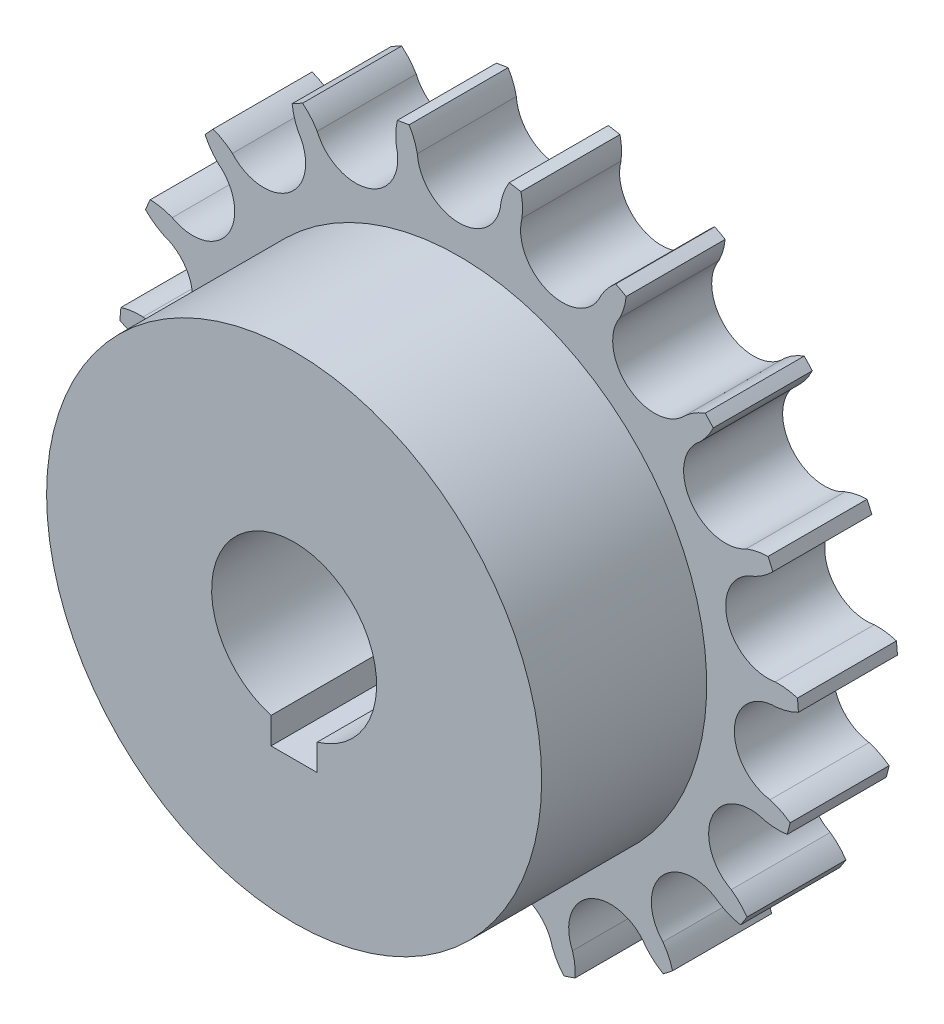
ISO-10303-21;
HEADER;
FILE_DESCRIPTION(('STEP AP214'),'2;1');
FILE_NAME('part.step','',(''),(''),'','','');
FILE_SCHEMA(('AUTOMOTIVE_DESIGN { 1 0 10303 214 1 1 1 1 }'));
ENDSEC;
DATA;
#1=APPLICATION_CONTEXT('core data for automotive mechanical design processes');
#2=APPLICATION_PROTOCOL_DEFINITION('international standard','automotive_design',2000,#1);
#3=PRODUCT_CONTEXT('',#1,'mechanical');
#4=PRODUCT('Part','Part','',(#3));
#5=PRODUCT_RELATED_PRODUCT_CATEGORY('part','',(#4));
#6=PRODUCT_DEFINITION_FORMATION('','',#4);
#7=PRODUCT_DEFINITION_CONTEXT('part definition',#1,'design');
#8=PRODUCT_DEFINITION('design','',#6,#7);
#9=PRODUCT_DEFINITION_SHAPE('','',#8);
#10=(LENGTH_UNIT() NAMED_UNIT(*) SI_UNIT(.MILLI.,.METRE.));
#11=(NAMED_UNIT(*) PLANE_ANGLE_UNIT() SI_UNIT($,.RADIAN.));
#12=(NAMED_UNIT(*) SI_UNIT($,.STERADIAN.) SOLID_ANGLE_UNIT());
#13=UNCERTAINTY_MEASURE_WITH_UNIT(LENGTH_MEASURE(1.E-05),#10,'distance_accuracy_value','');
#14=(GEOMETRIC_REPRESENTATION_CONTEXT(3) GLOBAL_UNCERTAINTY_ASSIGNED_CONTEXT((#13)) GLOBAL_UNIT_ASSIGNED_CONTEXT((#10,
#11,#12)) REPRESENTATION_CONTEXT('',''));
#15=CARTESIAN_POINT('',(0.,0.,0.));
#16=DIRECTION('',(0.,0.,1.));
#17=DIRECTION('',(1.,0.,0.));
#18=AXIS2_PLACEMENT_3D('',#15,#16,#17);
#19=CARTESIAN_POINT('',(0.,0.,0.));
#20=DIRECTION('',(0.,0.,1.));
#21=DIRECTION('',(1.,0.,0.));
#22=AXIS2_PLACEMENT_3D('',#19,#20,#21);
#23=CYLINDRICAL_SURFACE('',#22,12.5);
#24=CARTESIAN_POINT('',(0.,0.,40.));
#25=DIRECTION('',(0.,0.,1.));
#26=DIRECTION('',(1.,0.,0.));
#27=AXIS2_PLACEMENT_3D('',#24,#25,#26);
#28=CIRCLE('',#27,12.5);
#29=CARTESIAN_POINT('',(3.50000000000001,-12.,40.));
#30=VERTEX_POINT('',#29);
#31=CARTESIAN_POINT('',(-3.5,-12.,40.));
#32=VERTEX_POINT('',#31);
#33=EDGE_CURVE('E564',#30,#32,#28,.T.);
#34=ORIENTED_EDGE('',*,*,#33,.T.);
#35=DIRECTION('',(0.,0.,1.));
#36=VECTOR('',#35,1.);
#37=CARTESIAN_POINT('',(-3.5,-12.,0.));
#38=LINE('',#37,#36);
#39=CARTESIAN_POINT('',(-3.5,-12.,5.));
#40=VERTEX_POINT('',#39);
#41=EDGE_CURVE('E541',#32,#40,#38,.F.);
#42=ORIENTED_EDGE('',*,*,#41,.T.);
#43=CARTESIAN_POINT('',(0.,0.,5.));
#44=DIRECTION('',(0.,0.,-1.));
#45=DIRECTION('',(-1.,0.,0.));
#46=AXIS2_PLACEMENT_3D('',#43,#44,#45);
#47=CIRCLE('',#46,12.5);
#48=CARTESIAN_POINT('',(3.5,-12.,5.));
#49=VERTEX_POINT('',#48);
#50=EDGE_CURVE('E563',#49,#40,#47,.F.);
#51=ORIENTED_EDGE('',*,*,#50,.F.);
#52=DIRECTION('',(0.,0.,1.));
#53=VECTOR('',#52,1.);
#54=CARTESIAN_POINT('',(3.5,-12.,0.));
#55=LINE('',#54,#53);
#56=EDGE_CURVE('E552',#49,#30,#55,.T.);
#57=ORIENTED_EDGE('',*,*,#56,.T.);
#58=EDGE_LOOP('',(#34,#42,#51,#57));
#59=FACE_BOUND('',#58,.T.);
#60=ADVANCED_FACE('F31',(#59),#23,.F.);
#61=CARTESIAN_POINT('',(7.85900803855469,22.9460027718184,15.));
#62=DIRECTION('',(0.,0.,-1.));
#63=DIRECTION('',(-1.,0.,0.));
#64=AXIS2_PLACEMENT_3D('',#61,#62,#63);
#65=PLANE('',#64);
#66=CARTESIAN_POINT('',(15.7180160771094,45.8920055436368,15.));
#67=DIRECTION('',(0.,0.,1.));
#68=DIRECTION('',(-1.,0.,0.));
#69=AXIS2_PLACEMENT_3D('',#66,#67,#68);
#70=CIRCLE('',#69,9.57);
#71=CARTESIAN_POINT('',(7.58651220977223,50.9381471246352,15.));
#72=VERTEX_POINT('',#71);
#73=CARTESIAN_POINT('',(6.33609328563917,47.7799739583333,15.));
#74=VERTEX_POINT('',#73);
#75=EDGE_CURVE('E722',#72,#74,#70,.T.);
#76=ORIENTED_EDGE('',*,*,#75,.T.);
#77=CARTESIAN_POINT('',(0.,48.2,15.));
#78=DIRECTION('',(0.,0.,-1.));
#79=DIRECTION('',(1.,0.,0.));
#80=AXIS2_PLACEMENT_3D('',#77,#78,#79);
#81=CIRCLE('',#80,6.35);
#82=CARTESIAN_POINT('',(-6.33609328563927,47.7799739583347,15.));
#83=VERTEX_POINT('',#82);
#84=EDGE_CURVE('E724',#74,#83,#81,.T.);
#85=ORIENTED_EDGE('',*,*,#84,.T.);
#86=CARTESIAN_POINT('',(-15.7180160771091,45.8920055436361,15.));
#87=DIRECTION('',(0.,0.,1.));
#88=DIRECTION('',(1.,0.,0.));
#89=AXIS2_PLACEMENT_3D('',#86,#87,#88);
#90=CIRCLE('',#89,9.57);
#91=CARTESIAN_POINT('',(-7.58651220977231,50.9381471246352,15.));
#92=VERTEX_POINT('',#91);
#93=EDGE_CURVE('E726',#83,#92,#90,.T.);
#94=ORIENTED_EDGE('',*,*,#93,.T.);
#95=CARTESIAN_POINT('',(0.,0.,15.));
#96=DIRECTION('',(0.,0.,1.));
#97=DIRECTION('',(1.,0.,0.));
#98=AXIS2_PLACEMENT_3D('',#95,#96,#97);
#99=CIRCLE('',#98,51.5);
#100=CARTESIAN_POINT('',(-9.36413528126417,50.6415142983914,15.));
#101=VERTEX_POINT('',#100);
#102=EDGE_CURVE('E728',#92,#101,#99,.T.);
#103=ORIENTED_EDGE('',*,*,#102,.T.);
#104=CARTESIAN_POINT('',(-0.0347392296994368,48.5090815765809,15.));
#105=DIRECTION('',(0.,0.,1.));
#106=DIRECTION('',(-1.,0.,0.));
#107=AXIS2_PLACEMENT_3D('',#104,#105,#106);
#108=CIRCLE('',#107,9.57);
#109=CARTESIAN_POINT('',(-9.52134590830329,47.2484493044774,15.));
#110=VERTEX_POINT('',#109);
#111=EDGE_CURVE('E730',#101,#110,#108,.T.);
#112=ORIENTED_EDGE('',*,*,#111,.T.);
#113=CARTESIAN_POINT('',(-15.6505144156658,45.5883910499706,15.));
#114=DIRECTION('',(0.,0.,-1.));
#115=DIRECTION('',(1.,0.,0.));
#116=AXIS2_PLACEMENT_3D('',#113,#114,#115);
#117=CIRCLE('',#116,6.35);
#118=CARTESIAN_POINT('',(-21.5069184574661,43.1337970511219,15.));
#119=VERTEX_POINT('',#118);
#120=EDGE_CURVE('E732',#110,#119,#117,.T.);
#121=ORIENTED_EDGE('',*,*,#120,.T.);
#122=CARTESIAN_POINT('',(-29.7674804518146,38.3018186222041,15.));
#123=DIRECTION('',(0.,0.,1.));
#124=DIRECTION('',(1.,0.,0.));
#125=AXIS2_PLACEMENT_3D('',#122,#123,#124);
#126=CIRCLE('',#125,9.57);
#127=CARTESIAN_POINT('',(-23.7150433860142,45.7148413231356,15.));
#128=VERTEX_POINT('',#127);
#129=EDGE_CURVE('E734',#119,#128,#126,.T.);
#130=ORIENTED_EDGE('',*,*,#129,.T.);
#131=CARTESIAN_POINT('',(0.,0.,15.));
#132=DIRECTION('',(0.,0.,1.));
#133=DIRECTION('',(1.,0.,0.));
#134=AXIS2_PLACEMENT_3D('',#131,#132,#133);
#135=CIRCLE('',#134,51.5);
#136=CARTESIAN_POINT('',(-25.300033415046,44.8570876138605,15.));
#137=VERTEX_POINT('',#136);
#138=EDGE_CURVE('E736',#128,#137,#135,.T.);
#139=ORIENTED_EDGE('',*,*,#138,.T.);
#140=CARTESIAN_POINT('',(-15.7837300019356,45.8694459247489,15.));
#141=DIRECTION('',(0.,0.,1.));
#142=DIRECTION('',(-1.,0.,0.));
#143=AXIS2_PLACEMENT_3D('',#140,#141,#142);
#144=CIRCLE('',#143,9.57000000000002);
#145=CARTESIAN_POINT('',(-24.3469995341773,41.5968220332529,15.));
#146=VERTEX_POINT('',#145);
#147=EDGE_CURVE('E738',#137,#146,#144,.T.);
#148=ORIENTED_EDGE('',*,*,#147,.T.);
#149=CARTESIAN_POINT('',(-29.605052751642,38.0365725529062,15.));
#150=DIRECTION('',(0.,0.,-1.));
#151=DIRECTION('',(1.,0.,0.));
#152=AXIS2_PLACEMENT_3D('',#149,#150,#151);
#153=CIRCLE('',#152,6.34999999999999);
#154=CARTESIAN_POINT('',(-34.3471353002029,33.8134039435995,15.));
#155=VERTEX_POINT('',#154);
#156=EDGE_CURVE('E740',#146,#155,#153,.T.);
#157=ORIENTED_EDGE('',*,*,#156,.T.);
#158=CARTESIAN_POINT('',(-40.5911764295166,26.5610353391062,15.));
#159=DIRECTION('',(0.,0.,1.));
#160=DIRECTION('',(1.,0.,0.));
#161=AXIS2_PLACEMENT_3D('',#158,#159,#160);
#162=CIRCLE('',#161,9.57);
#163=CARTESIAN_POINT('',(-37.2736816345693,35.5376231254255,15.));
#164=VERTEX_POINT('',#163);
#165=EDGE_CURVE('E742',#155,#164,#162,.T.);
#166=ORIENTED_EDGE('',*,*,#165,.T.);
#167=CARTESIAN_POINT('',(0.,0.,15.));
#168=DIRECTION('',(0.,0.,1.));
#169=DIRECTION('',(1.,0.,0.));
#170=AXIS2_PLACEMENT_3D('',#167,#168,#169);
#171=CIRCLE('',#170,51.5);
#172=CARTESIAN_POINT('',(-38.4942803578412,34.2116994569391,15.));
#173=VERTEX_POINT('',#172);
#174=EDGE_CURVE('E744',#164,#173,#171,.T.);
#175=ORIENTED_EDGE('',*,*,#174,.T.);
#176=CARTESIAN_POINT('',(-29.8223087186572,38.2591440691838,15.));
#177=DIRECTION('',(0.,0.,1.));
#178=DIRECTION('',(-1.,0.,0.));
#179=AXIS2_PLACEMENT_3D('',#176,#177,#178);
#180=CIRCLE('',#179,9.57000000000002);
#181=CARTESIAN_POINT('',(-36.5342779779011,31.4375336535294,15.));
#182=VERTEX_POINT('',#181);
#183=EDGE_CURVE('E746',#173,#182,#180,.T.);
#184=ORIENTED_EDGE('',*,*,#183,.T.);
#185=CARTESIAN_POINT('',(-40.3514242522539,26.362901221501,15.));
#186=DIRECTION('',(0.,0.,-1.));
#187=DIRECTION('',(1.,0.,0.));
#188=AXIS2_PLACEMENT_3D('',#185,#186,#187);
#189=CIRCLE('',#188,6.34999999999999);
#190=CARTESIAN_POINT('',(-43.4653070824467,20.8288038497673,15.));
#191=VERTEX_POINT('',#190);
#192=EDGE_CURVE('E748',#182,#191,#189,.T.);
#193=ORIENTED_EDGE('',*,*,#192,.T.);
#194=CARTESIAN_POINT('',(-47.0161886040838,11.9419517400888,15.));
#195=DIRECTION('',(0.,0.,1.));
#196=DIRECTION('',(1.,0.,0.));
#197=AXIS2_PLACEMENT_3D('',#194,#195,#196);
#198=CIRCLE('',#197,9.57);
#199=CARTESIAN_POINT('',(-46.7931381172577,21.5093520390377,15.));
#200=VERTEX_POINT('',#199);
#201=EDGE_CURVE('E750',#191,#200,#198,.T.);
#202=ORIENTED_EDGE('',*,*,#201,.T.);
#203=CARTESIAN_POINT('',(0.,0.,15.));
#204=DIRECTION('',(0.,0.,1.));
#205=DIRECTION('',(1.,0.,0.));
#206=AXIS2_PLACEMENT_3D('',#203,#204,#205);
#207=CIRCLE('',#206,51.5);
#208=CARTESIAN_POINT('',(-47.5170747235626,19.858942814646,15.));
#209=VERTEX_POINT('',#208);
#210=EDGE_CURVE('E752',#200,#209,#207,.T.);
#211=ORIENTED_EDGE('',*,*,#210,.T.);
#212=CARTESIAN_POINT('',(-40.6291775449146,26.5028703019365,15.));
#213=DIRECTION('',(0.,0.,1.));
#214=DIRECTION('',(-1.,0.,0.));
#215=AXIS2_PLACEMENT_3D('',#212,#213,#214);
#216=CIRCLE('',#215,9.57000000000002);
#217=CARTESIAN_POINT('',(-44.762500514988,17.8715006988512,15.));
#218=VERTEX_POINT('',#217);
#219=EDGE_CURVE('E754',#209,#218,#216,.T.);
#220=ORIENTED_EDGE('',*,*,#219,.T.);
#221=CARTESIAN_POINT('',(-46.7250928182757,11.8324004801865,15.));
#222=DIRECTION('',(0.,0.,-1.));
#223=DIRECTION('',(1.,0.,0.));
#224=AXIS2_PLACEMENT_3D('',#221,#222,#223);
#225=CIRCLE('',#224,6.34999999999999);
#226=CARTESIAN_POINT('',(-47.8733384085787,5.58707966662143,15.));
#227=VERTEX_POINT('',#226);
#228=EDGE_CURVE('E756',#218,#227,#225,.T.);
#229=ORIENTED_EDGE('',*,*,#228,.T.);
#230=CARTESIAN_POINT('',(-48.3462672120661,-3.97122762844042,15.));
#231=DIRECTION('',(0.,0.,1.));
#232=DIRECTION('',(1.,0.,0.));
#233=AXIS2_PLACEMENT_3D('',#230,#231,#232);
#234=CIRCLE('',#233,9.57);
#235=CARTESIAN_POINT('',(-51.2418320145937,5.15020890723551,15.));
#236=VERTEX_POINT('',#235);
#237=EDGE_CURVE('E758',#227,#236,#234,.T.);
#238=ORIENTED_EDGE('',*,*,#237,.T.);
#239=CARTESIAN_POINT('',(0.,0.,15.));
#240=DIRECTION('',(0.,0.,1.));
#241=DIRECTION('',(1.,0.,0.));
#242=AXIS2_PLACEMENT_3D('',#239,#240,#241);
#243=CIRCLE('',#242,51.5);
#244=CARTESIAN_POINT('',(-51.3906567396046,3.35416157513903,15.));
#245=VERTEX_POINT('',#244);
#246=EDGE_CURVE('E760',#236,#245,#243,.T.);
#247=ORIENTED_EDGE('',*,*,#246,.T.);
#248=CARTESIAN_POINT('',(-47.0332445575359,11.8745993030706,15.));
#249=DIRECTION('',(0.,0.,1.));
#250=DIRECTION('',(-1.,0.,0.));
#251=AXIS2_PLACEMENT_3D('',#248,#249,#250);
#252=CIRCLE('',#251,9.57000000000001);
#253=CARTESIAN_POINT('',(-48.1400115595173,2.36881333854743,15.));
#254=VERTEX_POINT('',#253);
#255=EDGE_CURVE('E762',#245,#254,#252,.T.);
#256=ORIENTED_EDGE('',*,*,#255,.T.);
#257=CARTESIAN_POINT('',(-48.0353725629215,-3.9803244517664,15.));
#258=DIRECTION('',(0.,0.,-1.));
#259=DIRECTION('',(1.,0.,0.));
#260=AXIS2_PLACEMENT_3D('',#257,#258,#259);
#261=CIRCLE('',#260,6.35);
#262=CARTESIAN_POINT('',(-47.0935506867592,-10.2600912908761,15.));
#263=VERTEX_POINT('',#262);
#264=EDGE_CURVE('E764',#254,#263,#261,.T.);
#265=ORIENTED_EDGE('',*,*,#264,.T.);
#266=CARTESIAN_POINT('',(-44.4372775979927,-19.4540628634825,15.));
#267=DIRECTION('',(0.,0.,1.));
#268=DIRECTION('',(1.,0.,0.));
#269=AXIS2_PLACEMENT_3D('',#266,#267,#268);
#270=CIRCLE('',#269,9.57);
#271=CARTESIAN_POINT('',(-50.1376783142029,-11.7670392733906,15.));
#272=VERTEX_POINT('',#271);
#273=EDGE_CURVE('E766',#263,#272,#270,.T.);
#274=ORIENTED_EDGE('',*,*,#273,.T.);
#275=CARTESIAN_POINT('',(0.,0.,15.));
#276=DIRECTION('',(0.,0.,1.));
#277=DIRECTION('',(1.,0.,0.));
#278=AXIS2_PLACEMENT_3D('',#275,#276,#277);
#279=CIRCLE('',#278,51.5);
#280=CARTESIAN_POINT('',(-49.6952636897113,-13.5140951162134,15.));
#281=VERTEX_POINT('',#280);
#282=EDGE_CURVE('E768',#272,#281,#279,.T.);
#283=ORIENTED_EDGE('',*,*,#282,.T.);
#284=CARTESIAN_POINT('',(-48.3405297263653,-4.04046878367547,15.));
#285=DIRECTION('',(0.,0.,1.));
#286=DIRECTION('',(-1.,0.,0.));
#287=AXIS2_PLACEMENT_3D('',#284,#285,#286);
#288=CIRCLE('',#287,9.57000000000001);
#289=CARTESIAN_POINT('',(-46.3008053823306,-13.390571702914,15.));
#290=VERTEX_POINT('',#289);
#291=EDGE_CURVE('E770',#281,#290,#288,.T.);
#292=ORIENTED_EDGE('',*,*,#291,.T.);
#293=CARTESIAN_POINT('',(-44.1402743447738,-19.3617194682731,15.));
#294=DIRECTION('',(0.,0.,-1.));
#295=DIRECTION('',(1.,0.,0.));
#296=AXIS2_PLACEMENT_3D('',#293,#294,#295);
#297=CIRCLE('',#296,6.35);
#298=CARTESIAN_POINT('',(-41.2104460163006,-24.9954221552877,15.));
#299=VERTEX_POINT('',#298);
#300=EDGE_CURVE('E772',#290,#299,#297,.T.);
#301=ORIENTED_EDGE('',*,*,#300,.T.);
#302=CARTESIAN_POINT('',(-35.7128194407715,-32.8287485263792,15.));
#303=DIRECTION('',(0.,0.,1.));
#304=DIRECTION('',(1.,0.,0.));
#305=AXIS2_PLACEMENT_3D('',#302,#303,#304);
#306=CIRCLE('',#305,9.57);
#307=CARTESIAN_POINT('',(-43.6003292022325,-27.4091461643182,15.));
#308=VERTEX_POINT('',#307);
#309=EDGE_CURVE('E774',#299,#308,#306,.T.);
#310=ORIENTED_EDGE('',*,*,#309,.T.);
#311=CARTESIAN_POINT('',(0.,0.,15.));
#312=DIRECTION('',(0.,0.,1.));
#313=DIRECTION('',(1.,0.,0.));
#314=AXIS2_PLACEMENT_3D('',#311,#312,#313);
#315=CIRCLE('',#314,51.5);
#316=CARTESIAN_POINT('',(-42.6146177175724,-28.917889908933,15.));
#317=VERTEX_POINT('',#316);
#318=EDGE_CURVE('E776',#308,#317,#315,.T.);
#319=ORIENTED_EDGE('',*,*,#318,.T.);
#320=CARTESIAN_POINT('',(-44.4093684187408,-19.5176893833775,15.));
#321=DIRECTION('',(0.,0.,1.));
#322=DIRECTION('',(-1.,0.,0.));
#323=AXIS2_PLACEMENT_3D('',#320,#321,#322);
#324=CIRCLE('',#323,9.57000000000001);
#325=CARTESIAN_POINT('',(-39.4441885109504,-27.6988805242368,15.));
#326=VERTEX_POINT('',#325);
#327=EDGE_CURVE('E778',#317,#326,#324,.T.);
#328=ORIENTED_EDGE('',*,*,#327,.T.);
#329=CARTESIAN_POINT('',(-35.461892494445,-32.6449717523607,15.));
#330=DIRECTION('',(0.,0.,-1.));
#331=DIRECTION('',(1.,0.,0.));
#332=AXIS2_PLACEMENT_3D('',#329,#330,#331);
#333=CIRCLE('',#332,6.34999999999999);
#334=CARTESIAN_POINT('',(-30.8615500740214,-37.0221111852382,15.));
#335=VERTEX_POINT('',#334);
#336=EDGE_CURVE('E780',#326,#335,#333,.T.);
#337=ORIENTED_EDGE('',*,*,#336,.T.);
#338=CARTESIAN_POINT('',(-23.1183231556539,-42.6459298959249,15.));
#339=DIRECTION('',(0.,0.,1.));
#340=DIRECTION('',(1.,0.,0.));
#341=AXIS2_PLACEMENT_3D('',#338,#339,#340);
#342=CIRCLE('',#341,9.57);
#343=CARTESIAN_POINT('',(-32.3382078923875,-40.0810467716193,15.));
#344=VERTEX_POINT('',#343);
#345=EDGE_CURVE('E782',#335,#344,#342,.T.);
#346=ORIENTED_EDGE('',*,*,#345,.T.);
#347=CARTESIAN_POINT('',(0.,0.,15.));
#348=DIRECTION('',(0.,0.,1.));
#349=DIRECTION('',(1.,0.,0.));
#350=AXIS2_PLACEMENT_3D('',#347,#348,#349);
#351=CIRCLE('',#350,51.5);
#352=CARTESIAN_POINT('',(-30.9160166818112,-41.1879826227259,15.));
#353=VERTEX_POINT('',#352);
#354=EDGE_CURVE('E784',#344,#353,#351,.T.);
#355=ORIENTED_EDGE('',*,*,#354,.T.);
#356=CARTESIAN_POINT('',(-35.6657629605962,-32.8798654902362,15.));
#357=DIRECTION('',(0.,0.,1.));
#358=DIRECTION('',(-1.,0.,0.));
#359=AXIS2_PLACEMENT_3D('',#356,#357,#358);
#360=CIRCLE('',#359,9.57000000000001);
#361=CARTESIAN_POINT('',(-28.3131817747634,-39.0055858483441,15.));
#362=VERTEX_POINT('',#361);
#363=EDGE_CURVE('E786',#353,#362,#360,.T.);
#364=ORIENTED_EDGE('',*,*,#363,.T.);
#365=CARTESIAN_POINT('',(-22.940664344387,-42.3906348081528,15.));
#366=DIRECTION('',(0.,0.,-1.));
#367=DIRECTION('',(1.,0.,0.));
#368=AXIS2_PLACEMENT_3D('',#365,#366,#367);
#369=CIRCLE('',#368,6.35);
#370=CARTESIAN_POINT('',(-17.1683263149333,-45.0368800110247,15.));
#371=VERTEX_POINT('',#370);
#372=EDGE_CURVE('E788',#362,#371,#369,.T.);
#373=ORIENTED_EDGE('',*,*,#372,.T.);
#374=CARTESIAN_POINT('',(-8.01859783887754,-47.8417630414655,15.));
#375=DIRECTION('',(0.,0.,1.));
#376=DIRECTION('',(1.,0.,0.));
#377=AXIS2_PLACEMENT_3D('',#374,#375,#376);
#378=CIRCLE('',#377,9.56999999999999);
#379=CARTESIAN_POINT('',(-17.5717399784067,-48.409544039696,15.));
#380=VERTEX_POINT('',#379);
#381=EDGE_CURVE('E790',#371,#380,#378,.T.);
#382=ORIENTED_EDGE('',*,*,#381,.T.);
#383=CARTESIAN_POINT('',(0.,0.,15.));
#384=DIRECTION('',(0.,0.,1.));
#385=DIRECTION('',(1.,0.,0.));
#386=AXIS2_PLACEMENT_3D('',#383,#384,#385);
#387=CIRCLE('',#386,51.5);
#388=CARTESIAN_POINT('',(-15.8671855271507,-48.9947183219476,15.));
#389=VERTEX_POINT('',#388);
#390=EDGE_CURVE('E792',#380,#389,#387,.T.);
#391=ORIENTED_EDGE('',*,*,#390,.T.);
#392=CARTESIAN_POINT('',(-23.0572186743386,-42.6789979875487,15.));
#393=DIRECTION('',(0.,0.,1.));
#394=DIRECTION('',(-1.,0.,0.));
#395=AXIS2_PLACEMENT_3D('',#392,#393,#394);
#396=CIRCLE('',#395,9.57000000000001);
#397=CARTESIAN_POINT('',(-14.1140024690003,-46.0854307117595,15.));
#398=VERTEX_POINT('',#397);
#399=EDGE_CURVE('E794',#389,#398,#396,.T.);
#400=ORIENTED_EDGE('',*,*,#399,.T.);
#401=CARTESIAN_POINT('',(-7.93345925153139,-47.5426148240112,15.));
#402=DIRECTION('',(0.,0.,-1.));
#403=DIRECTION('',(1.,0.,0.));
#404=AXIS2_PLACEMENT_3D('',#401,#402,#403);
#405=CIRCLE('',#404,6.34999999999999);
#406=CARTESIAN_POINT('',(-1.61464800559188,-48.1712040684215,15.));
#407=VERTEX_POINT('',#406);
#408=EDGE_CURVE('E796',#398,#407,#405,.T.);
#409=ORIENTED_EDGE('',*,*,#408,.T.);
#410=CARTESIAN_POINT('',(7.95006697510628,-47.8531988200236,15.));
#411=DIRECTION('',(0.,0.,1.));
#412=DIRECTION('',(1.,0.,0.));
#413=AXIS2_PLACEMENT_3D('',#410,#411,#412);
#414=CIRCLE('',#413,9.56999999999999);
#415=CARTESIAN_POINT('',(-0.901101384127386,-51.492116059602,15.));
#416=VERTEX_POINT('',#415);
#417=EDGE_CURVE('E798',#407,#416,#414,.T.);
#418=ORIENTED_EDGE('',*,*,#417,.T.);
#419=CARTESIAN_POINT('',(0.,0.,15.));
#420=DIRECTION('',(0.,0.,1.));
#421=DIRECTION('',(1.,0.,0.));
#422=AXIS2_PLACEMENT_3D('',#419,#420,#421);
#423=CIRCLE('',#422,51.5);
#424=CARTESIAN_POINT('',(0.901101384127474,-51.492116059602,15.));
#425=VERTEX_POINT('',#424);
#426=EDGE_CURVE('E800',#416,#425,#423,.T.);
#427=ORIENTED_EDGE('',*,*,#426,.T.);
#428=CARTESIAN_POINT('',(-7.9500669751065,-47.8531988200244,15.));
#429=DIRECTION('',(0.,0.,1.));
#430=DIRECTION('',(-1.,0.,0.));
#431=AXIS2_PLACEMENT_3D('',#428,#429,#430);
#432=CIRCLE('',#431,9.57000000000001);
#433=CARTESIAN_POINT('',(1.61464800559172,-48.1712040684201,15.));
#434=VERTEX_POINT('',#433);
#435=EDGE_CURVE('E802',#425,#434,#432,.T.);
#436=ORIENTED_EDGE('',*,*,#435,.T.);
#437=CARTESIAN_POINT('',(7.93345925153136,-47.5426148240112,15.));
#438=DIRECTION('',(0.,0.,-1.));
#439=DIRECTION('',(1.,0.,0.));
#440=AXIS2_PLACEMENT_3D('',#437,#438,#439);
#441=CIRCLE('',#440,6.34999999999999);
#442=CARTESIAN_POINT('',(14.1140024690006,-46.0854307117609,15.));
#443=VERTEX_POINT('',#442);
#444=EDGE_CURVE('E804',#434,#443,#441,.T.);
#445=ORIENTED_EDGE('',*,*,#444,.T.);
#446=CARTESIAN_POINT('',(23.0572186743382,-42.6789979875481,15.));
#447=DIRECTION('',(0.,0.,1.));
#448=DIRECTION('',(1.,0.,0.));
#449=AXIS2_PLACEMENT_3D('',#446,#447,#448);
#450=CIRCLE('',#449,9.57);
#451=CARTESIAN_POINT('',(15.8671855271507,-48.9947183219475,15.));
#452=VERTEX_POINT('',#451);
#453=EDGE_CURVE('E806',#443,#452,#450,.T.);
#454=ORIENTED_EDGE('',*,*,#453,.T.);
#455=CARTESIAN_POINT('',(0.,0.,15.));
#456=DIRECTION('',(0.,0.,1.));
#457=DIRECTION('',(1.,0.,0.));
#458=AXIS2_PLACEMENT_3D('',#455,#456,#457);
#459=CIRCLE('',#458,51.5);
#460=CARTESIAN_POINT('',(17.5717399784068,-48.409544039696,15.));
#461=VERTEX_POINT('',#460);
#462=EDGE_CURVE('E808',#452,#461,#459,.T.);
#463=ORIENTED_EDGE('',*,*,#462,.T.);
#464=CARTESIAN_POINT('',(8.01859783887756,-47.8417630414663,15.));
#465=DIRECTION('',(0.,0.,1.));
#466=DIRECTION('',(-1.,0.,0.));
#467=AXIS2_PLACEMENT_3D('',#464,#465,#466);
#468=CIRCLE('',#467,9.57000000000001);
#469=CARTESIAN_POINT('',(17.1683263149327,-45.0368800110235,15.));
#470=VERTEX_POINT('',#469);
#471=EDGE_CURVE('E810',#461,#470,#468,.T.);
#472=ORIENTED_EDGE('',*,*,#471,.T.);
#473=CARTESIAN_POINT('',(22.9406643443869,-42.3906348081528,15.));
#474=DIRECTION('',(0.,0.,-1.));
#475=DIRECTION('',(1.,0.,0.));
#476=AXIS2_PLACEMENT_3D('',#473,#474,#475);
#477=CIRCLE('',#476,6.34999999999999);
#478=CARTESIAN_POINT('',(28.3131817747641,-39.0055858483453,15.));
#479=VERTEX_POINT('',#478);
#480=EDGE_CURVE('E812',#470,#479,#477,.T.);
#481=ORIENTED_EDGE('',*,*,#480,.T.);
#482=CARTESIAN_POINT('',(35.6657629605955,-32.8798654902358,15.));
#483=DIRECTION('',(0.,0.,1.));
#484=DIRECTION('',(1.,0.,0.));
#485=AXIS2_PLACEMENT_3D('',#482,#483,#484);
#486=CIRCLE('',#485,9.57);
#487=CARTESIAN_POINT('',(30.9160166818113,-41.1879826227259,15.));
#488=VERTEX_POINT('',#487);
#489=EDGE_CURVE('E814',#479,#488,#486,.T.);
#490=ORIENTED_EDGE('',*,*,#489,.T.);
#491=CARTESIAN_POINT('',(0.,0.,15.));
#492=DIRECTION('',(0.,0.,1.));
#493=DIRECTION('',(1.,0.,0.));
#494=AXIS2_PLACEMENT_3D('',#491,#492,#493);
#495=CIRCLE('',#494,51.5);
#496=CARTESIAN_POINT('',(32.3382078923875,-40.0810467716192,15.));
#497=VERTEX_POINT('',#496);
#498=EDGE_CURVE('E816',#488,#497,#495,.T.);
#499=ORIENTED_EDGE('',*,*,#498,.T.);
#500=CARTESIAN_POINT('',(23.1183231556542,-42.6459298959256,15.));
#501=DIRECTION('',(0.,0.,1.));
#502=DIRECTION('',(-1.,0.,0.));
#503=AXIS2_PLACEMENT_3D('',#500,#501,#502);
#504=CIRCLE('',#503,9.57000000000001);
#505=CARTESIAN_POINT('',(30.8615500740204,-37.0221111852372,15.));
#506=VERTEX_POINT('',#505);
#507=EDGE_CURVE('E818',#497,#506,#504,.T.);
#508=ORIENTED_EDGE('',*,*,#507,.T.);
#509=CARTESIAN_POINT('',(35.4618924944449,-32.6449717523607,15.));
#510=DIRECTION('',(0.,0.,-1.));
#511=DIRECTION('',(1.,0.,0.));
#512=AXIS2_PLACEMENT_3D('',#509,#510,#511);
#513=CIRCLE('',#512,6.34999999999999);
#514=CARTESIAN_POINT('',(39.4441885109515,-27.6988805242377,15.));
#515=VERTEX_POINT('',#514);
#516=EDGE_CURVE('E820',#506,#515,#513,.T.);
#517=ORIENTED_EDGE('',*,*,#516,.T.);
#518=CARTESIAN_POINT('',(44.4093684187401,-19.5176893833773,15.));
#519=DIRECTION('',(0.,0.,1.));
#520=DIRECTION('',(1.,0.,0.));
#521=AXIS2_PLACEMENT_3D('',#518,#519,#520);
#522=CIRCLE('',#521,9.57);
#523=CARTESIAN_POINT('',(42.6146177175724,-28.917889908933,15.));
#524=VERTEX_POINT('',#523);
#525=EDGE_CURVE('E822',#515,#524,#522,.T.);
#526=ORIENTED_EDGE('',*,*,#525,.T.);
#527=CARTESIAN_POINT('',(0.,0.,15.));
#528=DIRECTION('',(0.,0.,1.));
#529=DIRECTION('',(1.,0.,0.));
#530=AXIS2_PLACEMENT_3D('',#527,#528,#529);
#531=CIRCLE('',#530,51.5);
#532=CARTESIAN_POINT('',(43.6003292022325,-27.4091461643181,15.));
#533=VERTEX_POINT('',#532);
#534=EDGE_CURVE('E824',#524,#533,#531,.T.);
#535=ORIENTED_EDGE('',*,*,#534,.T.);
#536=CARTESIAN_POINT('',(35.7128194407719,-32.8287485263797,15.));
#537=DIRECTION('',(0.,0.,1.));
#538=DIRECTION('',(-1.,0.,0.));
#539=AXIS2_PLACEMENT_3D('',#536,#537,#538);
#540=CIRCLE('',#539,9.57000000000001);
#541=CARTESIAN_POINT('',(41.2104460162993,-24.9954221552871,15.));
#542=VERTEX_POINT('',#541);
#543=EDGE_CURVE('E826',#533,#542,#540,.T.);
#544=ORIENTED_EDGE('',*,*,#543,.T.);
#545=CARTESIAN_POINT('',(44.1402743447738,-19.3617194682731,15.));
#546=DIRECTION('',(0.,0.,-1.));
#547=DIRECTION('',(1.,0.,0.));
#548=AXIS2_PLACEMENT_3D('',#545,#546,#547);
#549=CIRCLE('',#548,6.35);
#550=CARTESIAN_POINT('',(46.3008053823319,-13.3905717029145,15.));
#551=VERTEX_POINT('',#550);
#552=EDGE_CURVE('E828',#542,#551,#549,.T.);
#553=ORIENTED_EDGE('',*,*,#552,.T.);
#554=CARTESIAN_POINT('',(48.3405297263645,-4.0404687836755,15.));
#555=DIRECTION('',(0.,0.,1.));
#556=DIRECTION('',(1.,0.,0.));
#557=AXIS2_PLACEMENT_3D('',#554,#555,#556);
#558=CIRCLE('',#557,9.57);
#559=CARTESIAN_POINT('',(49.6952636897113,-13.5140951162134,15.));
#560=VERTEX_POINT('',#559);
#561=EDGE_CURVE('E830',#551,#560,#558,.T.);
#562=ORIENTED_EDGE('',*,*,#561,.T.);
#563=CARTESIAN_POINT('',(0.,0.,15.));
#564=DIRECTION('',(0.,0.,1.));
#565=DIRECTION('',(1.,0.,0.));
#566=AXIS2_PLACEMENT_3D('',#563,#564,#565);
#567=CIRCLE('',#566,51.5);
#568=CARTESIAN_POINT('',(50.1376783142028,-11.7670392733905,15.));
#569=VERTEX_POINT('',#568);
#570=EDGE_CURVE('E832',#560,#569,#567,.T.);
#571=ORIENTED_EDGE('',*,*,#570,.T.);
#572=CARTESIAN_POINT('',(44.4372775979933,-19.4540628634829,15.));
#573=DIRECTION('',(0.,0.,1.));
#574=DIRECTION('',(-1.,0.,0.));
#575=AXIS2_PLACEMENT_3D('',#572,#573,#574);
#576=CIRCLE('',#575,9.57000000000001);
#577=CARTESIAN_POINT('',(47.0935506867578,-10.2600912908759,15.));
#578=VERTEX_POINT('',#577);
#579=EDGE_CURVE('E834',#569,#578,#576,.T.);
#580=ORIENTED_EDGE('',*,*,#579,.T.);
#581=CARTESIAN_POINT('',(48.0353725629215,-3.98032445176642,15.));
#582=DIRECTION('',(0.,0.,-1.));
#583=DIRECTION('',(1.,0.,0.));
#584=AXIS2_PLACEMENT_3D('',#581,#582,#583);
#585=CIRCLE('',#584,6.35);
#586=CARTESIAN_POINT('',(48.1400115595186,2.3688133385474,15.));
#587=VERTEX_POINT('',#586);
#588=EDGE_CURVE('E836',#578,#587,#585,.T.);
#589=ORIENTED_EDGE('',*,*,#588,.T.);
#590=CARTESIAN_POINT('',(47.0332445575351,11.8745993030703,15.));
#591=DIRECTION('',(0.,0.,1.));
#592=DIRECTION('',(1.,0.,0.));
#593=AXIS2_PLACEMENT_3D('',#590,#591,#592);
#594=CIRCLE('',#593,9.57);
#595=CARTESIAN_POINT('',(51.3906567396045,3.3541615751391,15.));
#596=VERTEX_POINT('',#595);
#597=EDGE_CURVE('E838',#587,#596,#594,.T.);
#598=ORIENTED_EDGE('',*,*,#597,.T.);
#599=CARTESIAN_POINT('',(0.,0.,15.));
#600=DIRECTION('',(0.,0.,1.));
#601=DIRECTION('',(1.,0.,0.));
#602=AXIS2_PLACEMENT_3D('',#599,#600,#601);
#603=CIRCLE('',#602,51.5);
#604=CARTESIAN_POINT('',(51.2418320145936,5.15020890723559,15.));
#605=VERTEX_POINT('',#604);
#606=EDGE_CURVE('E840',#596,#605,#603,.T.);
#607=ORIENTED_EDGE('',*,*,#606,.T.);
#608=CARTESIAN_POINT('',(48.3462672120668,-3.97122762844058,15.));
#609=DIRECTION('',(0.,0.,1.));
#610=DIRECTION('',(-1.,0.,0.));
#611=AXIS2_PLACEMENT_3D('',#608,#609,#610);
#612=CIRCLE('',#611,9.57);
#613=CARTESIAN_POINT('',(47.8733384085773,5.58707966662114,15.));
#614=VERTEX_POINT('',#613);
#615=EDGE_CURVE('E842',#605,#614,#612,.T.);
#616=ORIENTED_EDGE('',*,*,#615,.T.);
#617=CARTESIAN_POINT('',(46.7250928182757,11.8324004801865,15.));
#618=DIRECTION('',(0.,0.,-1.));
#619=DIRECTION('',(1.,0.,0.));
#620=AXIS2_PLACEMENT_3D('',#617,#618,#619);
#621=CIRCLE('',#620,6.35);
#622=CARTESIAN_POINT('',(44.7625005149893,17.8715006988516,15.));
#623=VERTEX_POINT('',#622);
#624=EDGE_CURVE('E844',#614,#623,#621,.T.);
#625=ORIENTED_EDGE('',*,*,#624,.T.);
#626=CARTESIAN_POINT('',(40.6291775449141,26.502870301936,15.));
#627=DIRECTION('',(0.,0.,1.));
#628=DIRECTION('',(1.,0.,0.));
#629=AXIS2_PLACEMENT_3D('',#626,#627,#628);
#630=CIRCLE('',#629,9.57);
#631=CARTESIAN_POINT('',(47.5170747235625,19.858942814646,15.));
#632=VERTEX_POINT('',#631);
#633=EDGE_CURVE('E846',#623,#632,#630,.T.);
#634=ORIENTED_EDGE('',*,*,#633,.T.);
#635=CARTESIAN_POINT('',(0.,0.,15.));
#636=DIRECTION('',(0.,0.,1.));
#637=DIRECTION('',(1.,0.,0.));
#638=AXIS2_PLACEMENT_3D('',#635,#636,#637);
#639=CIRCLE('',#638,51.5);
#640=CARTESIAN_POINT('',(46.7931381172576,21.5093520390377,15.));
#641=VERTEX_POINT('',#640);
#642=EDGE_CURVE('E848',#632,#641,#639,.T.);
#643=ORIENTED_EDGE('',*,*,#642,.T.);
#644=CARTESIAN_POINT('',(47.0161886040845,11.9419517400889,15.));
#645=DIRECTION('',(0.,0.,1.));
#646=DIRECTION('',(-1.,0.,0.));
#647=AXIS2_PLACEMENT_3D('',#644,#645,#646);
#648=CIRCLE('',#647,9.57);
#649=CARTESIAN_POINT('',(43.4653070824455,20.8288038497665,15.));
#650=VERTEX_POINT('',#649);
#651=EDGE_CURVE('E850',#641,#650,#648,.T.);
#652=ORIENTED_EDGE('',*,*,#651,.T.);
#653=CARTESIAN_POINT('',(40.3514242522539,26.362901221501,15.));
#654=DIRECTION('',(0.,0.,-1.));
#655=DIRECTION('',(1.,0.,0.));
#656=AXIS2_PLACEMENT_3D('',#653,#654,#655);
#657=CIRCLE('',#656,6.35);
#658=CARTESIAN_POINT('',(36.5342779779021,31.4375336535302,15.));
#659=VERTEX_POINT('',#658);
#660=EDGE_CURVE('E852',#650,#659,#657,.T.);
#661=ORIENTED_EDGE('',*,*,#660,.T.);
#662=CARTESIAN_POINT('',(29.8223087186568,38.2591440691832,15.));
#663=DIRECTION('',(0.,0.,1.));
#664=DIRECTION('',(1.,0.,0.));
#665=AXIS2_PLACEMENT_3D('',#662,#663,#664);
#666=CIRCLE('',#665,9.57);
#667=CARTESIAN_POINT('',(38.4942803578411,34.2116994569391,15.));
#668=VERTEX_POINT('',#667);
#669=EDGE_CURVE('E854',#659,#668,#666,.T.);
#670=ORIENTED_EDGE('',*,*,#669,.T.);
#671=CARTESIAN_POINT('',(0.,0.,15.));
#672=DIRECTION('',(0.,0.,1.));
#673=DIRECTION('',(1.,0.,0.));
#674=AXIS2_PLACEMENT_3D('',#671,#672,#673);
#675=CIRCLE('',#674,51.5);
#676=CARTESIAN_POINT('',(37.2736816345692,35.5376231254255,15.));
#677=VERTEX_POINT('',#676);
#678=EDGE_CURVE('E856',#668,#677,#675,.T.);
#679=ORIENTED_EDGE('',*,*,#678,.T.);
#680=CARTESIAN_POINT('',(40.5911764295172,26.5610353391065,15.));
#681=DIRECTION('',(0.,0.,1.));
#682=DIRECTION('',(-1.,0.,0.));
#683=AXIS2_PLACEMENT_3D('',#680,#681,#682);
#684=CIRCLE('',#683,9.57);
#685=CARTESIAN_POINT('',(34.347135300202,33.8134039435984,15.));
#686=VERTEX_POINT('',#685);
#687=EDGE_CURVE('E858',#677,#686,#684,.T.);
#688=ORIENTED_EDGE('',*,*,#687,.T.);
#689=CARTESIAN_POINT('',(29.605052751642,38.0365725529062,15.));
#690=DIRECTION('',(0.,0.,-1.));
#691=DIRECTION('',(1.,0.,0.));
#692=AXIS2_PLACEMENT_3D('',#689,#690,#691);
#693=CIRCLE('',#692,6.35);
#694=CARTESIAN_POINT('',(24.346999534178,41.596822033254,15.));
#695=VERTEX_POINT('',#694);
#696=EDGE_CURVE('E860',#686,#695,#693,.T.);
#697=ORIENTED_EDGE('',*,*,#696,.T.);
#698=CARTESIAN_POINT('',(15.7837300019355,45.8694459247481,15.));
#699=DIRECTION('',(0.,0.,1.));
#700=DIRECTION('',(1.,0.,0.));
#701=AXIS2_PLACEMENT_3D('',#698,#699,#700);
#702=CIRCLE('',#701,9.57);
#703=CARTESIAN_POINT('',(25.3000334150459,44.8570876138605,15.));
#704=VERTEX_POINT('',#703);
#705=EDGE_CURVE('E862',#695,#704,#702,.T.);
#706=ORIENTED_EDGE('',*,*,#705,.T.);
#707=CARTESIAN_POINT('',(0.,0.,15.));
#708=DIRECTION('',(0.,0.,1.));
#709=DIRECTION('',(1.,0.,0.));
#710=AXIS2_PLACEMENT_3D('',#707,#708,#709);
#711=CIRCLE('',#710,51.5);
#712=CARTESIAN_POINT('',(23.7150433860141,45.7148413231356,15.));
#713=VERTEX_POINT('',#712);
#714=EDGE_CURVE('E864',#704,#713,#711,.T.);
#715=ORIENTED_EDGE('',*,*,#714,.T.);
#716=CARTESIAN_POINT('',(29.7674804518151,38.3018186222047,15.));
#717=DIRECTION('',(0.,0.,1.));
#718=DIRECTION('',(-1.,0.,0.));
#719=AXIS2_PLACEMENT_3D('',#716,#717,#718);
#720=CIRCLE('',#719,9.56999999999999);
#721=CARTESIAN_POINT('',(21.5069184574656,43.1337970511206,15.));
#722=VERTEX_POINT('',#721);
#723=EDGE_CURVE('E866',#713,#722,#720,.T.);
#724=ORIENTED_EDGE('',*,*,#723,.T.);
#725=CARTESIAN_POINT('',(15.6505144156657,45.5883910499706,15.));
#726=DIRECTION('',(0.,0.,-1.));
#727=DIRECTION('',(1.,0.,0.));
#728=AXIS2_PLACEMENT_3D('',#725,#726,#727);
#729=CIRCLE('',#728,6.35);
#730=CARTESIAN_POINT('',(9.52134590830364,47.2484493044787,15.));
#731=VERTEX_POINT('',#730);
#732=EDGE_CURVE('E868',#722,#731,#729,.T.);
#733=ORIENTED_EDGE('',*,*,#732,.T.);
#734=CARTESIAN_POINT('',(0.0347392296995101,48.5090815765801,15.));
#735=DIRECTION('',(0.,0.,1.));
#736=DIRECTION('',(1.,0.,0.));
#737=AXIS2_PLACEMENT_3D('',#734,#735,#736);
#738=CIRCLE('',#737,9.57);
#739=CARTESIAN_POINT('',(9.36413528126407,50.6415142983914,15.));
#740=VERTEX_POINT('',#739);
#741=EDGE_CURVE('E870',#731,#740,#738,.T.);
#742=ORIENTED_EDGE('',*,*,#741,.T.);
#743=CARTESIAN_POINT('',(0.,0.,15.));
#744=DIRECTION('',(0.,0.,1.));
#745=DIRECTION('',(1.,0.,0.));
#746=AXIS2_PLACEMENT_3D('',#743,#744,#745);
#747=CIRCLE('',#746,51.5);
#748=EDGE_CURVE('E54',#740,#72,#747,.T.);
#749=ORIENTED_EDGE('',*,*,#748,.T.);
#750=EDGE_LOOP('',(#76,#85,#94,#103,#112,#121,#130,#139,#148,#157,#166,#175,#184,#193,#202,#211,
#220,#229,#238,#247,#256,#265,#274,#283,#292,#301,#310,#319,#328,#337,#346,#355,#364,#373,#382,
#391,#400,#409,#418,#427,#436,#445,#454,#463,#472,#481,#490,#499,#508,#517,#526,#535,#544,#553,
#562,#571,#580,#589,#598,#607,#616,#625,#634,#643,#652,#661,#670,#679,#688,#697,#706,#715,#724,
#733,#742,#749));
#751=FACE_BOUND('',#750,.T.);
#752=CARTESIAN_POINT('',(0.,0.,15.));
#753=DIRECTION('',(0.,0.,-1.));
#754=DIRECTION('',(-1.,0.,0.));
#755=AXIS2_PLACEMENT_3D('',#752,#753,#754);
#756=CIRCLE('',#755,37.5);
#757=CARTESIAN_POINT('',(-37.5,0.,15.));
#758=VERTEX_POINT('',#757);
#759=EDGE_CURVE('E1101',#758,#758,#756,.F.);
#760=ORIENTED_EDGE('',*,*,#759,.F.);
#761=EDGE_LOOP('',(#760));
#762=FACE_BOUND('',#761,.T.);
#763=ADVANCED_FACE('F1115',(#751,#762),#65,.F.);
#764=CARTESIAN_POINT('',(15.7180160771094,45.8920055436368,15.));
#765=DIRECTION('',(0.,0.,-1.));
#766=DIRECTION('',(-1.,0.,0.));
#767=AXIS2_PLACEMENT_3D('',#764,#765,#766);
#768=CYLINDRICAL_SURFACE('',#767,9.57);
#769=CARTESIAN_POINT('',(15.7180160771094,45.8920055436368,0.));
#770=DIRECTION('',(0.,0.,1.));
#771=DIRECTION('',(-1.,0.,0.));
#772=AXIS2_PLACEMENT_3D('',#769,#770,#771);
#773=CIRCLE('',#772,9.57);
#774=CARTESIAN_POINT('',(7.58651220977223,50.9381471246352,0.));
#775=VERTEX_POINT('',#774);
#776=CARTESIAN_POINT('',(6.33609328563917,47.7799739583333,0.));
#777=VERTEX_POINT('',#776);
#778=EDGE_CURVE('E569',#775,#777,#773,.T.);
#779=ORIENTED_EDGE('',*,*,#778,.T.);
#780=DIRECTION('',(0.,0.,-1.));
#781=VECTOR('',#780,1.);
#782=CARTESIAN_POINT('',(6.33609328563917,47.7799739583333,15.));
#783=LINE('',#782,#781);
#784=EDGE_CURVE('E1098',#74,#777,#783,.T.);
#785=ORIENTED_EDGE('',*,*,#784,.F.);
#786=ORIENTED_EDGE('',*,*,#75,.F.);
#787=DIRECTION('',(0.,0.,-1.));
#788=VECTOR('',#787,1.);
#789=CARTESIAN_POINT('',(7.58651220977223,50.9381471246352,15.));
#790=LINE('',#789,#788);
#791=EDGE_CURVE('E873',#72,#775,#790,.T.);
#792=ORIENTED_EDGE('',*,*,#791,.T.);
#793=EDGE_LOOP('',(#779,#785,#786,#792));
#794=FACE_BOUND('',#793,.T.);
#795=ADVANCED_FACE('F33',(#794),#768,.T.);
#796=CARTESIAN_POINT('',(0.,48.2,15.));
#797=DIRECTION('',(0.,0.,-1.));
#798=DIRECTION('',(-1.,0.,0.));
#799=AXIS2_PLACEMENT_3D('',#796,#797,#798);
#800=CYLINDRICAL_SURFACE('',#799,6.35);
#801=CARTESIAN_POINT('',(0.,48.2,0.));
#802=DIRECTION('',(0.,0.,-1.));
#803=DIRECTION('',(1.,0.,0.));
#804=AXIS2_PLACEMENT_3D('',#801,#802,#803);
#805=CIRCLE('',#804,6.35);
#806=CARTESIAN_POINT('',(-6.33609328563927,47.7799739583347,0.));
#807=VERTEX_POINT('',#806);
#808=EDGE_CURVE('E572',#777,#807,#805,.T.);
#809=ORIENTED_EDGE('',*,*,#808,.T.);
#810=DIRECTION('',(0.,0.,-1.));
#811=VECTOR('',#810,1.);
#812=CARTESIAN_POINT('',(-6.33609328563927,47.7799739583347,15.));
#813=LINE('',#812,#811);
#814=EDGE_CURVE('E1095',#83,#807,#813,.T.);
#815=ORIENTED_EDGE('',*,*,#814,.F.);
#816=ORIENTED_EDGE('',*,*,#84,.F.);
#817=ORIENTED_EDGE('',*,*,#784,.T.);
#818=EDGE_LOOP('',(#809,#815,#816,#817));
#819=FACE_BOUND('',#818,.T.);
#820=ADVANCED_FACE('F1429',(#819),#800,.F.);
#821=CARTESIAN_POINT('',(-15.7180160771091,45.8920055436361,15.));
#822=DIRECTION('',(0.,0.,-1.));
#823=DIRECTION('',(-1.,0.,0.));
#824=AXIS2_PLACEMENT_3D('',#821,#822,#823);
#825=CYLINDRICAL_SURFACE('',#824,9.57);
#826=CARTESIAN_POINT('',(-15.7180160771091,45.8920055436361,0.));
#827=DIRECTION('',(0.,0.,1.));
#828=DIRECTION('',(1.,0.,0.));
#829=AXIS2_PLACEMENT_3D('',#826,#827,#828);
#830=CIRCLE('',#829,9.57);
#831=CARTESIAN_POINT('',(-7.58651220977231,50.9381471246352,0.));
#832=VERTEX_POINT('',#831);
#833=EDGE_CURVE('E574',#807,#832,#830,.T.);
#834=ORIENTED_EDGE('',*,*,#833,.T.);
#835=DIRECTION('',(0.,0.,-1.));
#836=VECTOR('',#835,1.);
#837=CARTESIAN_POINT('',(-7.58651220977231,50.9381471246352,15.));
#838=LINE('',#837,#836);
#839=EDGE_CURVE('E1092',#92,#832,#838,.T.);
#840=ORIENTED_EDGE('',*,*,#839,.F.);
#841=ORIENTED_EDGE('',*,*,#93,.F.);
#842=ORIENTED_EDGE('',*,*,#814,.T.);
#843=EDGE_LOOP('',(#834,#840,#841,#842));
#844=FACE_BOUND('',#843,.T.);
#845=ADVANCED_FACE('F1426',(#844),#825,.T.);
#846=CARTESIAN_POINT('',(0.,0.,15.));
#847=DIRECTION('',(0.,0.,-1.));
#848=DIRECTION('',(-1.,0.,0.));
#849=AXIS2_PLACEMENT_3D('',#846,#847,#848);
#850=CYLINDRICAL_SURFACE('',#849,51.5);
#851=CARTESIAN_POINT('',(0.,0.,0.));
#852=DIRECTION('',(0.,0.,1.));
#853=DIRECTION('',(1.,0.,0.));
#854=AXIS2_PLACEMENT_3D('',#851,#852,#853);
#855=CIRCLE('',#854,51.5);
#856=CARTESIAN_POINT('',(-9.36413528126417,50.6415142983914,0.));
#857=VERTEX_POINT('',#856);
#858=EDGE_CURVE('E576',#832,#857,#855,.T.);
#859=ORIENTED_EDGE('',*,*,#858,.T.);
#860=DIRECTION('',(0.,0.,-1.));
#861=VECTOR('',#860,1.);
#862=CARTESIAN_POINT('',(-9.36413528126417,50.6415142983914,15.));
#863=LINE('',#862,#861);
#864=EDGE_CURVE('E1089',#101,#857,#863,.T.);
#865=ORIENTED_EDGE('',*,*,#864,.F.);
#866=ORIENTED_EDGE('',*,*,#102,.F.);
#867=ORIENTED_EDGE('',*,*,#839,.T.);
#868=EDGE_LOOP('',(#859,#865,#866,#867));
#869=FACE_BOUND('',#868,.T.);
#870=ADVANCED_FACE('F1422',(#869),#850,.T.);
#871=CARTESIAN_POINT('',(-0.0347392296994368,48.5090815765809,15.));
#872=DIRECTION('',(0.,0.,-1.));
#873=DIRECTION('',(-1.,0.,0.));
#874=AXIS2_PLACEMENT_3D('',#871,#872,#873);
#875=CYLINDRICAL_SURFACE('',#874,9.57);
#876=CARTESIAN_POINT('',(-0.0347392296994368,48.5090815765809,0.));
#877=DIRECTION('',(0.,0.,1.));
#878=DIRECTION('',(-1.,0.,0.));
#879=AXIS2_PLACEMENT_3D('',#876,#877,#878);
#880=CIRCLE('',#879,9.57);
#881=CARTESIAN_POINT('',(-9.52134590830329,47.2484493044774,0.));
#882=VERTEX_POINT('',#881);
#883=EDGE_CURVE('E578',#857,#882,#880,.T.);
#884=ORIENTED_EDGE('',*,*,#883,.T.);
#885=DIRECTION('',(0.,0.,-1.));
#886=VECTOR('',#885,1.);
#887=CARTESIAN_POINT('',(-9.52134590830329,47.2484493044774,15.));
#888=LINE('',#887,#886);
#889=EDGE_CURVE('E1086',#110,#882,#888,.T.);
#890=ORIENTED_EDGE('',*,*,#889,.F.);
#891=ORIENTED_EDGE('',*,*,#111,.F.);
#892=ORIENTED_EDGE('',*,*,#864,.T.);
#893=EDGE_LOOP('',(#884,#890,#891,#892));
#894=FACE_BOUND('',#893,.T.);
#895=ADVANCED_FACE('F1418',(#894),#875,.T.);
#896=CARTESIAN_POINT('',(-15.6505144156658,45.5883910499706,15.));
#897=DIRECTION('',(0.,0.,-1.));
#898=DIRECTION('',(-1.,0.,0.));
#899=AXIS2_PLACEMENT_3D('',#896,#897,#898);
#900=CYLINDRICAL_SURFACE('',#899,6.35);
#901=CARTESIAN_POINT('',(-15.6505144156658,45.5883910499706,0.));
#902=DIRECTION('',(0.,0.,-1.));
#903=DIRECTION('',(1.,0.,0.));
#904=AXIS2_PLACEMENT_3D('',#901,#902,#903);
#905=CIRCLE('',#904,6.35);
#906=CARTESIAN_POINT('',(-21.5069184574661,43.1337970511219,0.));
#907=VERTEX_POINT('',#906);
#908=EDGE_CURVE('E580',#882,#907,#905,.T.);
#909=ORIENTED_EDGE('',*,*,#908,.T.);
#910=DIRECTION('',(0.,0.,-1.));
#911=VECTOR('',#910,1.);
#912=CARTESIAN_POINT('',(-21.5069184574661,43.1337970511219,15.));
#913=LINE('',#912,#911);
#914=EDGE_CURVE('E1083',#119,#907,#913,.T.);
#915=ORIENTED_EDGE('',*,*,#914,.F.);
#916=ORIENTED_EDGE('',*,*,#120,.F.);
#917=ORIENTED_EDGE('',*,*,#889,.T.);
#918=EDGE_LOOP('',(#909,#915,#916,#917));
#919=FACE_BOUND('',#918,.T.);
#920=ADVANCED_FACE('F1414',(#919),#900,.F.);
#921=CARTESIAN_POINT('',(-29.7674804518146,38.3018186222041,15.));
#922=DIRECTION('',(0.,0.,-1.));
#923=DIRECTION('',(-1.,0.,0.));
#924=AXIS2_PLACEMENT_3D('',#921,#922,#923);
#925=CYLINDRICAL_SURFACE('',#924,9.57);
#926=CARTESIAN_POINT('',(-29.7674804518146,38.3018186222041,0.));
#927=DIRECTION('',(0.,0.,1.));
#928=DIRECTION('',(1.,0.,0.));
#929=AXIS2_PLACEMENT_3D('',#926,#927,#928);
#930=CIRCLE('',#929,9.57);
#931=CARTESIAN_POINT('',(-23.7150433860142,45.7148413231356,0.));
#932=VERTEX_POINT('',#931);
#933=EDGE_CURVE('E582',#907,#932,#930,.T.);
#934=ORIENTED_EDGE('',*,*,#933,.T.);
#935=DIRECTION('',(0.,0.,-1.));
#936=VECTOR('',#935,1.);
#937=CARTESIAN_POINT('',(-23.7150433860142,45.7148413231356,15.));
#938=LINE('',#937,#936);
#939=EDGE_CURVE('E1080',#128,#932,#938,.T.);
#940=ORIENTED_EDGE('',*,*,#939,.F.);
#941=ORIENTED_EDGE('',*,*,#129,.F.);
#942=ORIENTED_EDGE('',*,*,#914,.T.);
#943=EDGE_LOOP('',(#934,#940,#941,#942));
#944=FACE_BOUND('',#943,.T.);
#945=ADVANCED_FACE('F1410',(#944),#925,.T.);
#946=CARTESIAN_POINT('',(0.,0.,15.));
#947=DIRECTION('',(0.,0.,-1.));
#948=DIRECTION('',(-1.,0.,0.));
#949=AXIS2_PLACEMENT_3D('',#946,#947,#948);
#950=CYLINDRICAL_SURFACE('',#949,51.5);
#951=CARTESIAN_POINT('',(0.,0.,0.));
#952=DIRECTION('',(0.,0.,1.));
#953=DIRECTION('',(1.,0.,0.));
#954=AXIS2_PLACEMENT_3D('',#951,#952,#953);
#955=CIRCLE('',#954,51.5);
#956=CARTESIAN_POINT('',(-25.300033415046,44.8570876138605,0.));
#957=VERTEX_POINT('',#956);
#958=EDGE_CURVE('E584',#932,#957,#955,.T.);
#959=ORIENTED_EDGE('',*,*,#958,.T.);
#960=DIRECTION('',(0.,0.,-1.));
#961=VECTOR('',#960,1.);
#962=CARTESIAN_POINT('',(-25.300033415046,44.8570876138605,15.));
#963=LINE('',#962,#961);
#964=EDGE_CURVE('E1077',#137,#957,#963,.T.);
#965=ORIENTED_EDGE('',*,*,#964,.F.);
#966=ORIENTED_EDGE('',*,*,#138,.F.);
#967=ORIENTED_EDGE('',*,*,#939,.T.);
#968=EDGE_LOOP('',(#959,#965,#966,#967));
#969=FACE_BOUND('',#968,.T.);
#970=ADVANCED_FACE('F1406',(#969),#950,.T.);
#971=CARTESIAN_POINT('',(-15.7837300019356,45.8694459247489,15.));
#972=DIRECTION('',(0.,0.,-1.));
#973=DIRECTION('',(-1.,0.,0.));
#974=AXIS2_PLACEMENT_3D('',#971,#972,#973);
#975=CYLINDRICAL_SURFACE('',#974,9.57000000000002);
#976=CARTESIAN_POINT('',(-15.7837300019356,45.8694459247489,0.));
#977=DIRECTION('',(0.,0.,1.));
#978=DIRECTION('',(-1.,0.,0.));
#979=AXIS2_PLACEMENT_3D('',#976,#977,#978);
#980=CIRCLE('',#979,9.57000000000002);
#981=CARTESIAN_POINT('',(-24.3469995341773,41.5968220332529,0.));
#982=VERTEX_POINT('',#981);
#983=EDGE_CURVE('E586',#957,#982,#980,.T.);
#984=ORIENTED_EDGE('',*,*,#983,.T.);
#985=DIRECTION('',(0.,0.,-1.));
#986=VECTOR('',#985,1.);
#987=CARTESIAN_POINT('',(-24.3469995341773,41.5968220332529,15.));
#988=LINE('',#987,#986);
#989=EDGE_CURVE('E1074',#146,#982,#988,.T.);
#990=ORIENTED_EDGE('',*,*,#989,.F.);
#991=ORIENTED_EDGE('',*,*,#147,.F.);
#992=ORIENTED_EDGE('',*,*,#964,.T.);
#993=EDGE_LOOP('',(#984,#990,#991,#992));
#994=FACE_BOUND('',#993,.T.);
#995=ADVANCED_FACE('F1402',(#994),#975,.T.);
#996=CARTESIAN_POINT('',(-29.605052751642,38.0365725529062,15.));
#997=DIRECTION('',(0.,0.,-1.));
#998=DIRECTION('',(-1.,0.,0.));
#999=AXIS2_PLACEMENT_3D('',#996,#997,#998);
#1000=CYLINDRICAL_SURFACE('',#999,6.34999999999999);
#1001=CARTESIAN_POINT('',(-29.605052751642,38.0365725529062,0.));
#1002=DIRECTION('',(0.,0.,-1.));
#1003=DIRECTION('',(1.,0.,0.));
#1004=AXIS2_PLACEMENT_3D('',#1001,#1002,#1003);
#1005=CIRCLE('',#1004,6.34999999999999);
#1006=CARTESIAN_POINT('',(-34.3471353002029,33.8134039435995,0.));
#1007=VERTEX_POINT('',#1006);
#1008=EDGE_CURVE('E588',#982,#1007,#1005,.T.);
#1009=ORIENTED_EDGE('',*,*,#1008,.T.);
#1010=DIRECTION('',(0.,0.,-1.));
#1011=VECTOR('',#1010,1.);
#1012=CARTESIAN_POINT('',(-34.3471353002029,33.8134039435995,15.));
#1013=LINE('',#1012,#1011);
#1014=EDGE_CURVE('E1071',#155,#1007,#1013,.T.);
#1015=ORIENTED_EDGE('',*,*,#1014,.F.);
#1016=ORIENTED_EDGE('',*,*,#156,.F.);
#1017=ORIENTED_EDGE('',*,*,#989,.T.);
#1018=EDGE_LOOP('',(#1009,#1015,#1016,#1017));
#1019=FACE_BOUND('',#1018,.T.);
#1020=ADVANCED_FACE('F1398',(#1019),#1000,.F.);
#1021=CARTESIAN_POINT('',(-40.5911764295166,26.5610353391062,15.));
#1022=DIRECTION('',(0.,0.,-1.));
#1023=DIRECTION('',(-1.,0.,0.));
#1024=AXIS2_PLACEMENT_3D('',#1021,#1022,#1023);
#1025=CYLINDRICAL_SURFACE('',#1024,9.57);
#1026=CARTESIAN_POINT('',(-40.5911764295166,26.5610353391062,0.));
#1027=DIRECTION('',(0.,0.,1.));
#1028=DIRECTION('',(1.,0.,0.));
#1029=AXIS2_PLACEMENT_3D('',#1026,#1027,#1028);
#1030=CIRCLE('',#1029,9.57);
#1031=CARTESIAN_POINT('',(-37.2736816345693,35.5376231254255,0.));
#1032=VERTEX_POINT('',#1031);
#1033=EDGE_CURVE('E590',#1007,#1032,#1030,.T.);
#1034=ORIENTED_EDGE('',*,*,#1033,.T.);
#1035=DIRECTION('',(0.,0.,-1.));
#1036=VECTOR('',#1035,1.);
#1037=CARTESIAN_POINT('',(-37.2736816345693,35.5376231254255,15.));
#1038=LINE('',#1037,#1036);
#1039=EDGE_CURVE('E1068',#164,#1032,#1038,.T.);
#1040=ORIENTED_EDGE('',*,*,#1039,.F.);
#1041=ORIENTED_EDGE('',*,*,#165,.F.);
#1042=ORIENTED_EDGE('',*,*,#1014,.T.);
#1043=EDGE_LOOP('',(#1034,#1040,#1041,#1042));
#1044=FACE_BOUND('',#1043,.T.);
#1045=ADVANCED_FACE('F1394',(#1044),#1025,.T.);
#1046=CARTESIAN_POINT('',(0.,0.,15.));
#1047=DIRECTION('',(0.,0.,-1.));
#1048=DIRECTION('',(-1.,0.,0.));
#1049=AXIS2_PLACEMENT_3D('',#1046,#1047,#1048);
#1050=CYLINDRICAL_SURFACE('',#1049,51.5);
#1051=CARTESIAN_POINT('',(0.,0.,0.));
#1052=DIRECTION('',(0.,0.,1.));
#1053=DIRECTION('',(1.,0.,0.));
#1054=AXIS2_PLACEMENT_3D('',#1051,#1052,#1053);
#1055=CIRCLE('',#1054,51.5);
#1056=CARTESIAN_POINT('',(-38.4942803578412,34.2116994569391,0.));
#1057=VERTEX_POINT('',#1056);
#1058=EDGE_CURVE('E592',#1032,#1057,#1055,.T.);
#1059=ORIENTED_EDGE('',*,*,#1058,.T.);
#1060=DIRECTION('',(0.,0.,-1.));
#1061=VECTOR('',#1060,1.);
#1062=CARTESIAN_POINT('',(-38.4942803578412,34.2116994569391,15.));
#1063=LINE('',#1062,#1061);
#1064=EDGE_CURVE('E1065',#173,#1057,#1063,.T.);
#1065=ORIENTED_EDGE('',*,*,#1064,.F.);
#1066=ORIENTED_EDGE('',*,*,#174,.F.);
#1067=ORIENTED_EDGE('',*,*,#1039,.T.);
#1068=EDGE_LOOP('',(#1059,#1065,#1066,#1067));
#1069=FACE_BOUND('',#1068,.T.);
#1070=ADVANCED_FACE('F1390',(#1069),#1050,.T.);
#1071=CARTESIAN_POINT('',(-29.8223087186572,38.2591440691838,15.));
#1072=DIRECTION('',(0.,0.,-1.));
#1073=DIRECTION('',(-1.,0.,0.));
#1074=AXIS2_PLACEMENT_3D('',#1071,#1072,#1073);
#1075=CYLINDRICAL_SURFACE('',#1074,9.57000000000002);
#1076=CARTESIAN_POINT('',(-29.8223087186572,38.2591440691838,0.));
#1077=DIRECTION('',(0.,0.,1.));
#1078=DIRECTION('',(-1.,0.,0.));
#1079=AXIS2_PLACEMENT_3D('',#1076,#1077,#1078);
#1080=CIRCLE('',#1079,9.57000000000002);
#1081=CARTESIAN_POINT('',(-36.5342779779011,31.4375336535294,0.));
#1082=VERTEX_POINT('',#1081);
#1083=EDGE_CURVE('E594',#1057,#1082,#1080,.T.);
#1084=ORIENTED_EDGE('',*,*,#1083,.T.);
#1085=DIRECTION('',(0.,0.,-1.));
#1086=VECTOR('',#1085,1.);
#1087=CARTESIAN_POINT('',(-36.5342779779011,31.4375336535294,15.));
#1088=LINE('',#1087,#1086);
#1089=EDGE_CURVE('E1062',#182,#1082,#1088,.T.);
#1090=ORIENTED_EDGE('',*,*,#1089,.F.);
#1091=ORIENTED_EDGE('',*,*,#183,.F.);
#1092=ORIENTED_EDGE('',*,*,#1064,.T.);
#1093=EDGE_LOOP('',(#1084,#1090,#1091,#1092));
#1094=FACE_BOUND('',#1093,.T.);
#1095=ADVANCED_FACE('F1386',(#1094),#1075,.T.);
#1096=CARTESIAN_POINT('',(-40.3514242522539,26.362901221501,15.));
#1097=DIRECTION('',(0.,0.,-1.));
#1098=DIRECTION('',(-1.,0.,0.));
#1099=AXIS2_PLACEMENT_3D('',#1096,#1097,#1098);
#1100=CYLINDRICAL_SURFACE('',#1099,6.34999999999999);
#1101=CARTESIAN_POINT('',(-40.3514242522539,26.362901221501,0.));
#1102=DIRECTION('',(0.,0.,-1.));
#1103=DIRECTION('',(1.,0.,0.));
#1104=AXIS2_PLACEMENT_3D('',#1101,#1102,#1103);
#1105=CIRCLE('',#1104,6.34999999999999);
#1106=CARTESIAN_POINT('',(-43.4653070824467,20.8288038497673,0.));
#1107=VERTEX_POINT('',#1106);
#1108=EDGE_CURVE('E596',#1082,#1107,#1105,.T.);
#1109=ORIENTED_EDGE('',*,*,#1108,.T.);
#1110=DIRECTION('',(0.,0.,-1.));
#1111=VECTOR('',#1110,1.);
#1112=CARTESIAN_POINT('',(-43.4653070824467,20.8288038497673,15.));
#1113=LINE('',#1112,#1111);
#1114=EDGE_CURVE('E1059',#191,#1107,#1113,.T.);
#1115=ORIENTED_EDGE('',*,*,#1114,.F.);
#1116=ORIENTED_EDGE('',*,*,#192,.F.);
#1117=ORIENTED_EDGE('',*,*,#1089,.T.);
#1118=EDGE_LOOP('',(#1109,#1115,#1116,#1117));
#1119=FACE_BOUND('',#1118,.T.);
#1120=ADVANCED_FACE('F1382',(#1119),#1100,.F.);
#1121=CARTESIAN_POINT('',(-47.0161886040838,11.9419517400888,15.));
#1122=DIRECTION('',(0.,0.,-1.));
#1123=DIRECTION('',(-1.,0.,0.));
#1124=AXIS2_PLACEMENT_3D('',#1121,#1122,#1123);
#1125=CYLINDRICAL_SURFACE('',#1124,9.57);
#1126=CARTESIAN_POINT('',(-47.0161886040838,11.9419517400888,0.));
#1127=DIRECTION('',(0.,0.,1.));
#1128=DIRECTION('',(1.,0.,0.));
#1129=AXIS2_PLACEMENT_3D('',#1126,#1127,#1128);
#1130=CIRCLE('',#1129,9.57);
#1131=CARTESIAN_POINT('',(-46.7931381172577,21.5093520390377,0.));
#1132=VERTEX_POINT('',#1131);
#1133=EDGE_CURVE('E598',#1107,#1132,#1130,.T.);
#1134=ORIENTED_EDGE('',*,*,#1133,.T.);
#1135=DIRECTION('',(0.,0.,-1.));
#1136=VECTOR('',#1135,1.);
#1137=CARTESIAN_POINT('',(-46.7931381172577,21.5093520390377,15.));
#1138=LINE('',#1137,#1136);
#1139=EDGE_CURVE('E1056',#200,#1132,#1138,.T.);
#1140=ORIENTED_EDGE('',*,*,#1139,.F.);
#1141=ORIENTED_EDGE('',*,*,#201,.F.);
#1142=ORIENTED_EDGE('',*,*,#1114,.T.);
#1143=EDGE_LOOP('',(#1134,#1140,#1141,#1142));
#1144=FACE_BOUND('',#1143,.T.);
#1145=ADVANCED_FACE('F1378',(#1144),#1125,.T.);
#1146=CARTESIAN_POINT('',(0.,0.,15.));
#1147=DIRECTION('',(0.,0.,-1.));
#1148=DIRECTION('',(-1.,0.,0.));
#1149=AXIS2_PLACEMENT_3D('',#1146,#1147,#1148);
#1150=CYLINDRICAL_SURFACE('',#1149,51.5);
#1151=CARTESIAN_POINT('',(0.,0.,0.));
#1152=DIRECTION('',(0.,0.,1.));
#1153=DIRECTION('',(1.,0.,0.));
#1154=AXIS2_PLACEMENT_3D('',#1151,#1152,#1153);
#1155=CIRCLE('',#1154,51.5);
#1156=CARTESIAN_POINT('',(-47.5170747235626,19.858942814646,0.));
#1157=VERTEX_POINT('',#1156);
#1158=EDGE_CURVE('E600',#1132,#1157,#1155,.T.);
#1159=ORIENTED_EDGE('',*,*,#1158,.T.);
#1160=DIRECTION('',(0.,0.,-1.));
#1161=VECTOR('',#1160,1.);
#1162=CARTESIAN_POINT('',(-47.5170747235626,19.858942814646,15.));
#1163=LINE('',#1162,#1161);
#1164=EDGE_CURVE('E1053',#209,#1157,#1163,.T.);
#1165=ORIENTED_EDGE('',*,*,#1164,.F.);
#1166=ORIENTED_EDGE('',*,*,#210,.F.);
#1167=ORIENTED_EDGE('',*,*,#1139,.T.);
#1168=EDGE_LOOP('',(#1159,#1165,#1166,#1167));
#1169=FACE_BOUND('',#1168,.T.);
#1170=ADVANCED_FACE('F1374',(#1169),#1150,.T.);
#1171=CARTESIAN_POINT('',(-40.6291775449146,26.5028703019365,15.));
#1172=DIRECTION('',(0.,0.,-1.));
#1173=DIRECTION('',(-1.,0.,0.));
#1174=AXIS2_PLACEMENT_3D('',#1171,#1172,#1173);
#1175=CYLINDRICAL_SURFACE('',#1174,9.57000000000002);
#1176=CARTESIAN_POINT('',(-40.6291775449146,26.5028703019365,0.));
#1177=DIRECTION('',(0.,0.,1.));
#1178=DIRECTION('',(-1.,0.,0.));
#1179=AXIS2_PLACEMENT_3D('',#1176,#1177,#1178);
#1180=CIRCLE('',#1179,9.57000000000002);
#1181=CARTESIAN_POINT('',(-44.762500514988,17.8715006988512,0.));
#1182=VERTEX_POINT('',#1181);
#1183=EDGE_CURVE('E602',#1157,#1182,#1180,.T.);
#1184=ORIENTED_EDGE('',*,*,#1183,.T.);
#1185=DIRECTION('',(0.,0.,-1.));
#1186=VECTOR('',#1185,1.);
#1187=CARTESIAN_POINT('',(-44.762500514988,17.8715006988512,15.));
#1188=LINE('',#1187,#1186);
#1189=EDGE_CURVE('E1050',#218,#1182,#1188,.T.);
#1190=ORIENTED_EDGE('',*,*,#1189,.F.);
#1191=ORIENTED_EDGE('',*,*,#219,.F.);
#1192=ORIENTED_EDGE('',*,*,#1164,.T.);
#1193=EDGE_LOOP('',(#1184,#1190,#1191,#1192));
#1194=FACE_BOUND('',#1193,.T.);
#1195=ADVANCED_FACE('F1370',(#1194),#1175,.T.);
#1196=CARTESIAN_POINT('',(-46.7250928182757,11.8324004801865,15.));
#1197=DIRECTION('',(0.,0.,-1.));
#1198=DIRECTION('',(-1.,0.,0.));
#1199=AXIS2_PLACEMENT_3D('',#1196,#1197,#1198);
#1200=CYLINDRICAL_SURFACE('',#1199,6.34999999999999);
#1201=CARTESIAN_POINT('',(-46.7250928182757,11.8324004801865,0.));
#1202=DIRECTION('',(0.,0.,-1.));
#1203=DIRECTION('',(1.,0.,0.));
#1204=AXIS2_PLACEMENT_3D('',#1201,#1202,#1203);
#1205=CIRCLE('',#1204,6.34999999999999);
#1206=CARTESIAN_POINT('',(-47.8733384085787,5.58707966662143,0.));
#1207=VERTEX_POINT('',#1206);
#1208=EDGE_CURVE('E604',#1182,#1207,#1205,.T.);
#1209=ORIENTED_EDGE('',*,*,#1208,.T.);
#1210=DIRECTION('',(0.,0.,-1.));
#1211=VECTOR('',#1210,1.);
#1212=CARTESIAN_POINT('',(-47.8733384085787,5.58707966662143,15.));
#1213=LINE('',#1212,#1211);
#1214=EDGE_CURVE('E1047',#227,#1207,#1213,.T.);
#1215=ORIENTED_EDGE('',*,*,#1214,.F.);
#1216=ORIENTED_EDGE('',*,*,#228,.F.);
#1217=ORIENTED_EDGE('',*,*,#1189,.T.);
#1218=EDGE_LOOP('',(#1209,#1215,#1216,#1217));
#1219=FACE_BOUND('',#1218,.T.);
#1220=ADVANCED_FACE('F1366',(#1219),#1200,.F.);
#1221=CARTESIAN_POINT('',(-48.3462672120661,-3.97122762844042,15.));
#1222=DIRECTION('',(0.,0.,-1.));
#1223=DIRECTION('',(-1.,0.,0.));
#1224=AXIS2_PLACEMENT_3D('',#1221,#1222,#1223);
#1225=CYLINDRICAL_SURFACE('',#1224,9.57);
#1226=CARTESIAN_POINT('',(-48.3462672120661,-3.97122762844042,0.));
#1227=DIRECTION('',(0.,0.,1.));
#1228=DIRECTION('',(1.,0.,0.));
#1229=AXIS2_PLACEMENT_3D('',#1226,#1227,#1228);
#1230=CIRCLE('',#1229,9.57);
#1231=CARTESIAN_POINT('',(-51.2418320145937,5.15020890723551,0.));
#1232=VERTEX_POINT('',#1231);
#1233=EDGE_CURVE('E606',#1207,#1232,#1230,.T.);
#1234=ORIENTED_EDGE('',*,*,#1233,.T.);
#1235=DIRECTION('',(0.,0.,-1.));
#1236=VECTOR('',#1235,1.);
#1237=CARTESIAN_POINT('',(-51.2418320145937,5.15020890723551,15.));
#1238=LINE('',#1237,#1236);
#1239=EDGE_CURVE('E1044',#236,#1232,#1238,.T.);
#1240=ORIENTED_EDGE('',*,*,#1239,.F.);
#1241=ORIENTED_EDGE('',*,*,#237,.F.);
#1242=ORIENTED_EDGE('',*,*,#1214,.T.);
#1243=EDGE_LOOP('',(#1234,#1240,#1241,#1242));
#1244=FACE_BOUND('',#1243,.T.);
#1245=ADVANCED_FACE('F1362',(#1244),#1225,.T.);
#1246=CARTESIAN_POINT('',(0.,0.,15.));
#1247=DIRECTION('',(0.,0.,-1.));
#1248=DIRECTION('',(-1.,0.,0.));
#1249=AXIS2_PLACEMENT_3D('',#1246,#1247,#1248);
#1250=CYLINDRICAL_SURFACE('',#1249,51.5);
#1251=CARTESIAN_POINT('',(0.,0.,0.));
#1252=DIRECTION('',(0.,0.,1.));
#1253=DIRECTION('',(1.,0.,0.));
#1254=AXIS2_PLACEMENT_3D('',#1251,#1252,#1253);
#1255=CIRCLE('',#1254,51.5);
#1256=CARTESIAN_POINT('',(-51.3906567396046,3.35416157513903,0.));
#1257=VERTEX_POINT('',#1256);
#1258=EDGE_CURVE('E608',#1232,#1257,#1255,.T.);
#1259=ORIENTED_EDGE('',*,*,#1258,.T.);
#1260=DIRECTION('',(0.,0.,-1.));
#1261=VECTOR('',#1260,1.);
#1262=CARTESIAN_POINT('',(-51.3906567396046,3.35416157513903,15.));
#1263=LINE('',#1262,#1261);
#1264=EDGE_CURVE('E1041',#245,#1257,#1263,.T.);
#1265=ORIENTED_EDGE('',*,*,#1264,.F.);
#1266=ORIENTED_EDGE('',*,*,#246,.F.);
#1267=ORIENTED_EDGE('',*,*,#1239,.T.);
#1268=EDGE_LOOP('',(#1259,#1265,#1266,#1267));
#1269=FACE_BOUND('',#1268,.T.);
#1270=ADVANCED_FACE('F1358',(#1269),#1250,.T.);
#1271=CARTESIAN_POINT('',(-47.0332445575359,11.8745993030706,15.));
#1272=DIRECTION('',(0.,0.,-1.));
#1273=DIRECTION('',(-1.,0.,0.));
#1274=AXIS2_PLACEMENT_3D('',#1271,#1272,#1273);
#1275=CYLINDRICAL_SURFACE('',#1274,9.57000000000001);
#1276=CARTESIAN_POINT('',(-47.0332445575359,11.8745993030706,0.));
#1277=DIRECTION('',(0.,0.,1.));
#1278=DIRECTION('',(-1.,0.,0.));
#1279=AXIS2_PLACEMENT_3D('',#1276,#1277,#1278);
#1280=CIRCLE('',#1279,9.57000000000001);
#1281=CARTESIAN_POINT('',(-48.1400115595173,2.36881333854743,0.));
#1282=VERTEX_POINT('',#1281);
#1283=EDGE_CURVE('E610',#1257,#1282,#1280,.T.);
#1284=ORIENTED_EDGE('',*,*,#1283,.T.);
#1285=DIRECTION('',(0.,0.,-1.));
#1286=VECTOR('',#1285,1.);
#1287=CARTESIAN_POINT('',(-48.1400115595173,2.36881333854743,15.));
#1288=LINE('',#1287,#1286);
#1289=EDGE_CURVE('E1038',#254,#1282,#1288,.T.);
#1290=ORIENTED_EDGE('',*,*,#1289,.F.);
#1291=ORIENTED_EDGE('',*,*,#255,.F.);
#1292=ORIENTED_EDGE('',*,*,#1264,.T.);
#1293=EDGE_LOOP('',(#1284,#1290,#1291,#1292));
#1294=FACE_BOUND('',#1293,.T.);
#1295=ADVANCED_FACE('F1354',(#1294),#1275,.T.);
#1296=CARTESIAN_POINT('',(-48.0353725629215,-3.9803244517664,15.));
#1297=DIRECTION('',(0.,0.,-1.));
#1298=DIRECTION('',(-1.,0.,0.));
#1299=AXIS2_PLACEMENT_3D('',#1296,#1297,#1298);
#1300=CYLINDRICAL_SURFACE('',#1299,6.35);
#1301=CARTESIAN_POINT('',(-48.0353725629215,-3.9803244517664,0.));
#1302=DIRECTION('',(0.,0.,-1.));
#1303=DIRECTION('',(1.,0.,0.));
#1304=AXIS2_PLACEMENT_3D('',#1301,#1302,#1303);
#1305=CIRCLE('',#1304,6.35);
#1306=CARTESIAN_POINT('',(-47.0935506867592,-10.2600912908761,0.));
#1307=VERTEX_POINT('',#1306);
#1308=EDGE_CURVE('E612',#1282,#1307,#1305,.T.);
#1309=ORIENTED_EDGE('',*,*,#1308,.T.);
#1310=DIRECTION('',(0.,0.,-1.));
#1311=VECTOR('',#1310,1.);
#1312=CARTESIAN_POINT('',(-47.0935506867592,-10.2600912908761,15.));
#1313=LINE('',#1312,#1311);
#1314=EDGE_CURVE('E1035',#263,#1307,#1313,.T.);
#1315=ORIENTED_EDGE('',*,*,#1314,.F.);
#1316=ORIENTED_EDGE('',*,*,#264,.F.);
#1317=ORIENTED_EDGE('',*,*,#1289,.T.);
#1318=EDGE_LOOP('',(#1309,#1315,#1316,#1317));
#1319=FACE_BOUND('',#1318,.T.);
#1320=ADVANCED_FACE('F1350',(#1319),#1300,.F.);
#1321=CARTESIAN_POINT('',(-44.4372775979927,-19.4540628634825,15.));
#1322=DIRECTION('',(0.,0.,-1.));
#1323=DIRECTION('',(-1.,0.,0.));
#1324=AXIS2_PLACEMENT_3D('',#1321,#1322,#1323);
#1325=CYLINDRICAL_SURFACE('',#1324,9.57);
#1326=CARTESIAN_POINT('',(-44.4372775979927,-19.4540628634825,0.));
#1327=DIRECTION('',(0.,0.,1.));
#1328=DIRECTION('',(1.,0.,0.));
#1329=AXIS2_PLACEMENT_3D('',#1326,#1327,#1328);
#1330=CIRCLE('',#1329,9.57);
#1331=CARTESIAN_POINT('',(-50.1376783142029,-11.7670392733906,0.));
#1332=VERTEX_POINT('',#1331);
#1333=EDGE_CURVE('E614',#1307,#1332,#1330,.T.);
#1334=ORIENTED_EDGE('',*,*,#1333,.T.);
#1335=DIRECTION('',(0.,0.,-1.));
#1336=VECTOR('',#1335,1.);
#1337=CARTESIAN_POINT('',(-50.1376783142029,-11.7670392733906,15.));
#1338=LINE('',#1337,#1336);
#1339=EDGE_CURVE('E1032',#272,#1332,#1338,.T.);
#1340=ORIENTED_EDGE('',*,*,#1339,.F.);
#1341=ORIENTED_EDGE('',*,*,#273,.F.);
#1342=ORIENTED_EDGE('',*,*,#1314,.T.);
#1343=EDGE_LOOP('',(#1334,#1340,#1341,#1342));
#1344=FACE_BOUND('',#1343,.T.);
#1345=ADVANCED_FACE('F1346',(#1344),#1325,.T.);
#1346=CARTESIAN_POINT('',(0.,0.,15.));
#1347=DIRECTION('',(0.,0.,-1.));
#1348=DIRECTION('',(-1.,0.,0.));
#1349=AXIS2_PLACEMENT_3D('',#1346,#1347,#1348);
#1350=CYLINDRICAL_SURFACE('',#1349,51.5);
#1351=CARTESIAN_POINT('',(0.,0.,0.));
#1352=DIRECTION('',(0.,0.,1.));
#1353=DIRECTION('',(1.,0.,0.));
#1354=AXIS2_PLACEMENT_3D('',#1351,#1352,#1353);
#1355=CIRCLE('',#1354,51.5);
#1356=CARTESIAN_POINT('',(-49.6952636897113,-13.5140951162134,0.));
#1357=VERTEX_POINT('',#1356);
#1358=EDGE_CURVE('E616',#1332,#1357,#1355,.T.);
#1359=ORIENTED_EDGE('',*,*,#1358,.T.);
#1360=DIRECTION('',(0.,0.,-1.));
#1361=VECTOR('',#1360,1.);
#1362=CARTESIAN_POINT('',(-49.6952636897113,-13.5140951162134,15.));
#1363=LINE('',#1362,#1361);
#1364=EDGE_CURVE('E1029',#281,#1357,#1363,.T.);
#1365=ORIENTED_EDGE('',*,*,#1364,.F.);
#1366=ORIENTED_EDGE('',*,*,#282,.F.);
#1367=ORIENTED_EDGE('',*,*,#1339,.T.);
#1368=EDGE_LOOP('',(#1359,#1365,#1366,#1367));
#1369=FACE_BOUND('',#1368,.T.);
#1370=ADVANCED_FACE('F1342',(#1369),#1350,.T.);
#1371=CARTESIAN_POINT('',(-48.3405297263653,-4.04046878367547,15.));
#1372=DIRECTION('',(0.,0.,-1.));
#1373=DIRECTION('',(-1.,0.,0.));
#1374=AXIS2_PLACEMENT_3D('',#1371,#1372,#1373);
#1375=CYLINDRICAL_SURFACE('',#1374,9.57000000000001);
#1376=CARTESIAN_POINT('',(-48.3405297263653,-4.04046878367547,0.));
#1377=DIRECTION('',(0.,0.,1.));
#1378=DIRECTION('',(-1.,0.,0.));
#1379=AXIS2_PLACEMENT_3D('',#1376,#1377,#1378);
#1380=CIRCLE('',#1379,9.57000000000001);
#1381=CARTESIAN_POINT('',(-46.3008053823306,-13.390571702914,0.));
#1382=VERTEX_POINT('',#1381);
#1383=EDGE_CURVE('E618',#1357,#1382,#1380,.T.);
#1384=ORIENTED_EDGE('',*,*,#1383,.T.);
#1385=DIRECTION('',(0.,0.,-1.));
#1386=VECTOR('',#1385,1.);
#1387=CARTESIAN_POINT('',(-46.3008053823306,-13.390571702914,15.));
#1388=LINE('',#1387,#1386);
#1389=EDGE_CURVE('E1026',#290,#1382,#1388,.T.);
#1390=ORIENTED_EDGE('',*,*,#1389,.F.);
#1391=ORIENTED_EDGE('',*,*,#291,.F.);
#1392=ORIENTED_EDGE('',*,*,#1364,.T.);
#1393=EDGE_LOOP('',(#1384,#1390,#1391,#1392));
#1394=FACE_BOUND('',#1393,.T.);
#1395=ADVANCED_FACE('F1338',(#1394),#1375,.T.);
#1396=CARTESIAN_POINT('',(-44.1402743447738,-19.3617194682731,15.));
#1397=DIRECTION('',(0.,0.,-1.));
#1398=DIRECTION('',(-1.,0.,0.));
#1399=AXIS2_PLACEMENT_3D('',#1396,#1397,#1398);
#1400=CYLINDRICAL_SURFACE('',#1399,6.35);
#1401=CARTESIAN_POINT('',(-44.1402743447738,-19.3617194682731,0.));
#1402=DIRECTION('',(0.,0.,-1.));
#1403=DIRECTION('',(1.,0.,0.));
#1404=AXIS2_PLACEMENT_3D('',#1401,#1402,#1403);
#1405=CIRCLE('',#1404,6.35);
#1406=CARTESIAN_POINT('',(-41.2104460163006,-24.9954221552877,0.));
#1407=VERTEX_POINT('',#1406);
#1408=EDGE_CURVE('E620',#1382,#1407,#1405,.T.);
#1409=ORIENTED_EDGE('',*,*,#1408,.T.);
#1410=DIRECTION('',(0.,0.,-1.));
#1411=VECTOR('',#1410,1.);
#1412=CARTESIAN_POINT('',(-41.2104460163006,-24.9954221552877,15.));
#1413=LINE('',#1412,#1411);
#1414=EDGE_CURVE('E1023',#299,#1407,#1413,.T.);
#1415=ORIENTED_EDGE('',*,*,#1414,.F.);
#1416=ORIENTED_EDGE('',*,*,#300,.F.);
#1417=ORIENTED_EDGE('',*,*,#1389,.T.);
#1418=EDGE_LOOP('',(#1409,#1415,#1416,#1417));
#1419=FACE_BOUND('',#1418,.T.);
#1420=ADVANCED_FACE('F1334',(#1419),#1400,.F.);
#1421=CARTESIAN_POINT('',(-35.7128194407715,-32.8287485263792,15.));
#1422=DIRECTION('',(0.,0.,-1.));
#1423=DIRECTION('',(-1.,0.,0.));
#1424=AXIS2_PLACEMENT_3D('',#1421,#1422,#1423);
#1425=CYLINDRICAL_SURFACE('',#1424,9.57);
#1426=CARTESIAN_POINT('',(-35.7128194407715,-32.8287485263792,0.));
#1427=DIRECTION('',(0.,0.,1.));
#1428=DIRECTION('',(1.,0.,0.));
#1429=AXIS2_PLACEMENT_3D('',#1426,#1427,#1428);
#1430=CIRCLE('',#1429,9.57);
#1431=CARTESIAN_POINT('',(-43.6003292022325,-27.4091461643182,0.));
#1432=VERTEX_POINT('',#1431);
#1433=EDGE_CURVE('E622',#1407,#1432,#1430,.T.);
#1434=ORIENTED_EDGE('',*,*,#1433,.T.);
#1435=DIRECTION('',(0.,0.,-1.));
#1436=VECTOR('',#1435,1.);
#1437=CARTESIAN_POINT('',(-43.6003292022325,-27.4091461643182,15.));
#1438=LINE('',#1437,#1436);
#1439=EDGE_CURVE('E1020',#308,#1432,#1438,.T.);
#1440=ORIENTED_EDGE('',*,*,#1439,.F.);
#1441=ORIENTED_EDGE('',*,*,#309,.F.);
#1442=ORIENTED_EDGE('',*,*,#1414,.T.);
#1443=EDGE_LOOP('',(#1434,#1440,#1441,#1442));
#1444=FACE_BOUND('',#1443,.T.);
#1445=ADVANCED_FACE('F1330',(#1444),#1425,.T.);
#1446=CARTESIAN_POINT('',(0.,0.,15.));
#1447=DIRECTION('',(0.,0.,-1.));
#1448=DIRECTION('',(-1.,0.,0.));
#1449=AXIS2_PLACEMENT_3D('',#1446,#1447,#1448);
#1450=CYLINDRICAL_SURFACE('',#1449,51.5);
#1451=CARTESIAN_POINT('',(0.,0.,0.));
#1452=DIRECTION('',(0.,0.,1.));
#1453=DIRECTION('',(1.,0.,0.));
#1454=AXIS2_PLACEMENT_3D('',#1451,#1452,#1453);
#1455=CIRCLE('',#1454,51.5);
#1456=CARTESIAN_POINT('',(-42.6146177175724,-28.917889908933,0.));
#1457=VERTEX_POINT('',#1456);
#1458=EDGE_CURVE('E624',#1432,#1457,#1455,.T.);
#1459=ORIENTED_EDGE('',*,*,#1458,.T.);
#1460=DIRECTION('',(0.,0.,-1.));
#1461=VECTOR('',#1460,1.);
#1462=CARTESIAN_POINT('',(-42.6146177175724,-28.917889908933,15.));
#1463=LINE('',#1462,#1461);
#1464=EDGE_CURVE('E1017',#317,#1457,#1463,.T.);
#1465=ORIENTED_EDGE('',*,*,#1464,.F.);
#1466=ORIENTED_EDGE('',*,*,#318,.F.);
#1467=ORIENTED_EDGE('',*,*,#1439,.T.);
#1468=EDGE_LOOP('',(#1459,#1465,#1466,#1467));
#1469=FACE_BOUND('',#1468,.T.);
#1470=ADVANCED_FACE('F1326',(#1469),#1450,.T.);
#1471=CARTESIAN_POINT('',(-44.4093684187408,-19.5176893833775,15.));
#1472=DIRECTION('',(0.,0.,-1.));
#1473=DIRECTION('',(-1.,0.,0.));
#1474=AXIS2_PLACEMENT_3D('',#1471,#1472,#1473);
#1475=CYLINDRICAL_SURFACE('',#1474,9.57000000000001);
#1476=CARTESIAN_POINT('',(-44.4093684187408,-19.5176893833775,0.));
#1477=DIRECTION('',(0.,0.,1.));
#1478=DIRECTION('',(-1.,0.,0.));
#1479=AXIS2_PLACEMENT_3D('',#1476,#1477,#1478);
#1480=CIRCLE('',#1479,9.57000000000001);
#1481=CARTESIAN_POINT('',(-39.4441885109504,-27.6988805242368,0.));
#1482=VERTEX_POINT('',#1481);
#1483=EDGE_CURVE('E626',#1457,#1482,#1480,.T.);
#1484=ORIENTED_EDGE('',*,*,#1483,.T.);
#1485=DIRECTION('',(0.,0.,-1.));
#1486=VECTOR('',#1485,1.);
#1487=CARTESIAN_POINT('',(-39.4441885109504,-27.6988805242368,15.));
#1488=LINE('',#1487,#1486);
#1489=EDGE_CURVE('E1014',#326,#1482,#1488,.T.);
#1490=ORIENTED_EDGE('',*,*,#1489,.F.);
#1491=ORIENTED_EDGE('',*,*,#327,.F.);
#1492=ORIENTED_EDGE('',*,*,#1464,.T.);
#1493=EDGE_LOOP('',(#1484,#1490,#1491,#1492));
#1494=FACE_BOUND('',#1493,.T.);
#1495=ADVANCED_FACE('F1322',(#1494),#1475,.T.);
#1496=CARTESIAN_POINT('',(-35.461892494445,-32.6449717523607,15.));
#1497=DIRECTION('',(0.,0.,-1.));
#1498=DIRECTION('',(-1.,0.,0.));
#1499=AXIS2_PLACEMENT_3D('',#1496,#1497,#1498);
#1500=CYLINDRICAL_SURFACE('',#1499,6.34999999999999);
#1501=CARTESIAN_POINT('',(-35.461892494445,-32.6449717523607,0.));
#1502=DIRECTION('',(0.,0.,-1.));
#1503=DIRECTION('',(1.,0.,0.));
#1504=AXIS2_PLACEMENT_3D('',#1501,#1502,#1503);
#1505=CIRCLE('',#1504,6.34999999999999);
#1506=CARTESIAN_POINT('',(-30.8615500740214,-37.0221111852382,0.));
#1507=VERTEX_POINT('',#1506);
#1508=EDGE_CURVE('E628',#1482,#1507,#1505,.T.);
#1509=ORIENTED_EDGE('',*,*,#1508,.T.);
#1510=DIRECTION('',(0.,0.,-1.));
#1511=VECTOR('',#1510,1.);
#1512=CARTESIAN_POINT('',(-30.8615500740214,-37.0221111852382,15.));
#1513=LINE('',#1512,#1511);
#1514=EDGE_CURVE('E1011',#335,#1507,#1513,.T.);
#1515=ORIENTED_EDGE('',*,*,#1514,.F.);
#1516=ORIENTED_EDGE('',*,*,#336,.F.);
#1517=ORIENTED_EDGE('',*,*,#1489,.T.);
#1518=EDGE_LOOP('',(#1509,#1515,#1516,#1517));
#1519=FACE_BOUND('',#1518,.T.);
#1520=ADVANCED_FACE('F1318',(#1519),#1500,.F.);
#1521=CARTESIAN_POINT('',(-23.1183231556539,-42.6459298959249,15.));
#1522=DIRECTION('',(0.,0.,-1.));
#1523=DIRECTION('',(-1.,0.,0.));
#1524=AXIS2_PLACEMENT_3D('',#1521,#1522,#1523);
#1525=CYLINDRICAL_SURFACE('',#1524,9.57);
#1526=CARTESIAN_POINT('',(-23.1183231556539,-42.6459298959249,0.));
#1527=DIRECTION('',(0.,0.,1.));
#1528=DIRECTION('',(1.,0.,0.));
#1529=AXIS2_PLACEMENT_3D('',#1526,#1527,#1528);
#1530=CIRCLE('',#1529,9.57);
#1531=CARTESIAN_POINT('',(-32.3382078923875,-40.0810467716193,0.));
#1532=VERTEX_POINT('',#1531);
#1533=EDGE_CURVE('E630',#1507,#1532,#1530,.T.);
#1534=ORIENTED_EDGE('',*,*,#1533,.T.);
#1535=DIRECTION('',(0.,0.,-1.));
#1536=VECTOR('',#1535,1.);
#1537=CARTESIAN_POINT('',(-32.3382078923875,-40.0810467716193,15.));
#1538=LINE('',#1537,#1536);
#1539=EDGE_CURVE('E1008',#344,#1532,#1538,.T.);
#1540=ORIENTED_EDGE('',*,*,#1539,.F.);
#1541=ORIENTED_EDGE('',*,*,#345,.F.);
#1542=ORIENTED_EDGE('',*,*,#1514,.T.);
#1543=EDGE_LOOP('',(#1534,#1540,#1541,#1542));
#1544=FACE_BOUND('',#1543,.T.);
#1545=ADVANCED_FACE('F1314',(#1544),#1525,.T.);
#1546=CARTESIAN_POINT('',(0.,0.,15.));
#1547=DIRECTION('',(0.,0.,-1.));
#1548=DIRECTION('',(-1.,0.,0.));
#1549=AXIS2_PLACEMENT_3D('',#1546,#1547,#1548);
#1550=CYLINDRICAL_SURFACE('',#1549,51.5);
#1551=CARTESIAN_POINT('',(0.,0.,0.));
#1552=DIRECTION('',(0.,0.,1.));
#1553=DIRECTION('',(1.,0.,0.));
#1554=AXIS2_PLACEMENT_3D('',#1551,#1552,#1553);
#1555=CIRCLE('',#1554,51.5);
#1556=CARTESIAN_POINT('',(-30.9160166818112,-41.1879826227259,0.));
#1557=VERTEX_POINT('',#1556);
#1558=EDGE_CURVE('E632',#1532,#1557,#1555,.T.);
#1559=ORIENTED_EDGE('',*,*,#1558,.T.);
#1560=DIRECTION('',(0.,0.,-1.));
#1561=VECTOR('',#1560,1.);
#1562=CARTESIAN_POINT('',(-30.9160166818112,-41.1879826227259,15.));
#1563=LINE('',#1562,#1561);
#1564=EDGE_CURVE('E1005',#353,#1557,#1563,.T.);
#1565=ORIENTED_EDGE('',*,*,#1564,.F.);
#1566=ORIENTED_EDGE('',*,*,#354,.F.);
#1567=ORIENTED_EDGE('',*,*,#1539,.T.);
#1568=EDGE_LOOP('',(#1559,#1565,#1566,#1567));
#1569=FACE_BOUND('',#1568,.T.);
#1570=ADVANCED_FACE('F1310',(#1569),#1550,.T.);
#1571=CARTESIAN_POINT('',(-35.6657629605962,-32.8798654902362,15.));
#1572=DIRECTION('',(0.,0.,-1.));
#1573=DIRECTION('',(-1.,0.,0.));
#1574=AXIS2_PLACEMENT_3D('',#1571,#1572,#1573);
#1575=CYLINDRICAL_SURFACE('',#1574,9.57000000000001);
#1576=CARTESIAN_POINT('',(-35.6657629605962,-32.8798654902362,0.));
#1577=DIRECTION('',(0.,0.,1.));
#1578=DIRECTION('',(-1.,0.,0.));
#1579=AXIS2_PLACEMENT_3D('',#1576,#1577,#1578);
#1580=CIRCLE('',#1579,9.57000000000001);
#1581=CARTESIAN_POINT('',(-28.3131817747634,-39.0055858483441,0.));
#1582=VERTEX_POINT('',#1581);
#1583=EDGE_CURVE('E634',#1557,#1582,#1580,.T.);
#1584=ORIENTED_EDGE('',*,*,#1583,.T.);
#1585=DIRECTION('',(0.,0.,-1.));
#1586=VECTOR('',#1585,1.);
#1587=CARTESIAN_POINT('',(-28.3131817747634,-39.0055858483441,15.));
#1588=LINE('',#1587,#1586);
#1589=EDGE_CURVE('E1002',#362,#1582,#1588,.T.);
#1590=ORIENTED_EDGE('',*,*,#1589,.F.);
#1591=ORIENTED_EDGE('',*,*,#363,.F.);
#1592=ORIENTED_EDGE('',*,*,#1564,.T.);
#1593=EDGE_LOOP('',(#1584,#1590,#1591,#1592));
#1594=FACE_BOUND('',#1593,.T.);
#1595=ADVANCED_FACE('F1306',(#1594),#1575,.T.);
#1596=CARTESIAN_POINT('',(-22.940664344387,-42.3906348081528,15.));
#1597=DIRECTION('',(0.,0.,-1.));
#1598=DIRECTION('',(-1.,0.,0.));
#1599=AXIS2_PLACEMENT_3D('',#1596,#1597,#1598);
#1600=CYLINDRICAL_SURFACE('',#1599,6.35);
#1601=CARTESIAN_POINT('',(-22.940664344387,-42.3906348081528,0.));
#1602=DIRECTION('',(0.,0.,-1.));
#1603=DIRECTION('',(1.,0.,0.));
#1604=AXIS2_PLACEMENT_3D('',#1601,#1602,#1603);
#1605=CIRCLE('',#1604,6.35);
#1606=CARTESIAN_POINT('',(-17.1683263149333,-45.0368800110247,0.));
#1607=VERTEX_POINT('',#1606);
#1608=EDGE_CURVE('E636',#1582,#1607,#1605,.T.);
#1609=ORIENTED_EDGE('',*,*,#1608,.T.);
#1610=DIRECTION('',(0.,0.,-1.));
#1611=VECTOR('',#1610,1.);
#1612=CARTESIAN_POINT('',(-17.1683263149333,-45.0368800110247,15.));
#1613=LINE('',#1612,#1611);
#1614=EDGE_CURVE('E999',#371,#1607,#1613,.T.);
#1615=ORIENTED_EDGE('',*,*,#1614,.F.);
#1616=ORIENTED_EDGE('',*,*,#372,.F.);
#1617=ORIENTED_EDGE('',*,*,#1589,.T.);
#1618=EDGE_LOOP('',(#1609,#1615,#1616,#1617));
#1619=FACE_BOUND('',#1618,.T.);
#1620=ADVANCED_FACE('F1302',(#1619),#1600,.F.);
#1621=CARTESIAN_POINT('',(-8.01859783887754,-47.8417630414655,15.));
#1622=DIRECTION('',(0.,0.,-1.));
#1623=DIRECTION('',(-1.,0.,0.));
#1624=AXIS2_PLACEMENT_3D('',#1621,#1622,#1623);
#1625=CYLINDRICAL_SURFACE('',#1624,9.56999999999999);
#1626=CARTESIAN_POINT('',(-8.01859783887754,-47.8417630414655,0.));
#1627=DIRECTION('',(0.,0.,1.));
#1628=DIRECTION('',(1.,0.,0.));
#1629=AXIS2_PLACEMENT_3D('',#1626,#1627,#1628);
#1630=CIRCLE('',#1629,9.56999999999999);
#1631=CARTESIAN_POINT('',(-17.5717399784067,-48.409544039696,0.));
#1632=VERTEX_POINT('',#1631);
#1633=EDGE_CURVE('E638',#1607,#1632,#1630,.T.);
#1634=ORIENTED_EDGE('',*,*,#1633,.T.);
#1635=DIRECTION('',(0.,0.,-1.));
#1636=VECTOR('',#1635,1.);
#1637=CARTESIAN_POINT('',(-17.5717399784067,-48.409544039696,15.));
#1638=LINE('',#1637,#1636);
#1639=EDGE_CURVE('E996',#380,#1632,#1638,.T.);
#1640=ORIENTED_EDGE('',*,*,#1639,.F.);
#1641=ORIENTED_EDGE('',*,*,#381,.F.);
#1642=ORIENTED_EDGE('',*,*,#1614,.T.);
#1643=EDGE_LOOP('',(#1634,#1640,#1641,#1642));
#1644=FACE_BOUND('',#1643,.T.);
#1645=ADVANCED_FACE('F1298',(#1644),#1625,.T.);
#1646=CARTESIAN_POINT('',(0.,0.,15.));
#1647=DIRECTION('',(0.,0.,-1.));
#1648=DIRECTION('',(-1.,0.,0.));
#1649=AXIS2_PLACEMENT_3D('',#1646,#1647,#1648);
#1650=CYLINDRICAL_SURFACE('',#1649,51.5);
#1651=CARTESIAN_POINT('',(0.,0.,0.));
#1652=DIRECTION('',(0.,0.,1.));
#1653=DIRECTION('',(1.,0.,0.));
#1654=AXIS2_PLACEMENT_3D('',#1651,#1652,#1653);
#1655=CIRCLE('',#1654,51.5);
#1656=CARTESIAN_POINT('',(-15.8671855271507,-48.9947183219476,0.));
#1657=VERTEX_POINT('',#1656);
#1658=EDGE_CURVE('E640',#1632,#1657,#1655,.T.);
#1659=ORIENTED_EDGE('',*,*,#1658,.T.);
#1660=DIRECTION('',(0.,0.,-1.));
#1661=VECTOR('',#1660,1.);
#1662=CARTESIAN_POINT('',(-15.8671855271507,-48.9947183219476,15.));
#1663=LINE('',#1662,#1661);
#1664=EDGE_CURVE('E993',#389,#1657,#1663,.T.);
#1665=ORIENTED_EDGE('',*,*,#1664,.F.);
#1666=ORIENTED_EDGE('',*,*,#390,.F.);
#1667=ORIENTED_EDGE('',*,*,#1639,.T.);
#1668=EDGE_LOOP('',(#1659,#1665,#1666,#1667));
#1669=FACE_BOUND('',#1668,.T.);
#1670=ADVANCED_FACE('F1294',(#1669),#1650,.T.);
#1671=CARTESIAN_POINT('',(-23.0572186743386,-42.6789979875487,15.));
#1672=DIRECTION('',(0.,0.,-1.));
#1673=DIRECTION('',(-1.,0.,0.));
#1674=AXIS2_PLACEMENT_3D('',#1671,#1672,#1673);
#1675=CYLINDRICAL_SURFACE('',#1674,9.57000000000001);
#1676=CARTESIAN_POINT('',(-23.0572186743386,-42.6789979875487,0.));
#1677=DIRECTION('',(0.,0.,1.));
#1678=DIRECTION('',(-1.,0.,0.));
#1679=AXIS2_PLACEMENT_3D('',#1676,#1677,#1678);
#1680=CIRCLE('',#1679,9.57000000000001);
#1681=CARTESIAN_POINT('',(-14.1140024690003,-46.0854307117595,0.));
#1682=VERTEX_POINT('',#1681);
#1683=EDGE_CURVE('E642',#1657,#1682,#1680,.T.);
#1684=ORIENTED_EDGE('',*,*,#1683,.T.);
#1685=DIRECTION('',(0.,0.,-1.));
#1686=VECTOR('',#1685,1.);
#1687=CARTESIAN_POINT('',(-14.1140024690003,-46.0854307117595,15.));
#1688=LINE('',#1687,#1686);
#1689=EDGE_CURVE('E990',#398,#1682,#1688,.T.);
#1690=ORIENTED_EDGE('',*,*,#1689,.F.);
#1691=ORIENTED_EDGE('',*,*,#399,.F.);
#1692=ORIENTED_EDGE('',*,*,#1664,.T.);
#1693=EDGE_LOOP('',(#1684,#1690,#1691,#1692));
#1694=FACE_BOUND('',#1693,.T.);
#1695=ADVANCED_FACE('F1290',(#1694),#1675,.T.);
#1696=CARTESIAN_POINT('',(-7.93345925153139,-47.5426148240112,15.));
#1697=DIRECTION('',(0.,0.,-1.));
#1698=DIRECTION('',(-1.,0.,0.));
#1699=AXIS2_PLACEMENT_3D('',#1696,#1697,#1698);
#1700=CYLINDRICAL_SURFACE('',#1699,6.34999999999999);
#1701=CARTESIAN_POINT('',(-7.93345925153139,-47.5426148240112,0.));
#1702=DIRECTION('',(0.,0.,-1.));
#1703=DIRECTION('',(1.,0.,0.));
#1704=AXIS2_PLACEMENT_3D('',#1701,#1702,#1703);
#1705=CIRCLE('',#1704,6.34999999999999);
#1706=CARTESIAN_POINT('',(-1.61464800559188,-48.1712040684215,0.));
#1707=VERTEX_POINT('',#1706);
#1708=EDGE_CURVE('E644',#1682,#1707,#1705,.T.);
#1709=ORIENTED_EDGE('',*,*,#1708,.T.);
#1710=DIRECTION('',(0.,0.,-1.));
#1711=VECTOR('',#1710,1.);
#1712=CARTESIAN_POINT('',(-1.61464800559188,-48.1712040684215,15.));
#1713=LINE('',#1712,#1711);
#1714=EDGE_CURVE('E987',#407,#1707,#1713,.T.);
#1715=ORIENTED_EDGE('',*,*,#1714,.F.);
#1716=ORIENTED_EDGE('',*,*,#408,.F.);
#1717=ORIENTED_EDGE('',*,*,#1689,.T.);
#1718=EDGE_LOOP('',(#1709,#1715,#1716,#1717));
#1719=FACE_BOUND('',#1718,.T.);
#1720=ADVANCED_FACE('F1286',(#1719),#1700,.F.);
#1721=CARTESIAN_POINT('',(7.95006697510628,-47.8531988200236,15.));
#1722=DIRECTION('',(0.,0.,-1.));
#1723=DIRECTION('',(-1.,0.,0.));
#1724=AXIS2_PLACEMENT_3D('',#1721,#1722,#1723);
#1725=CYLINDRICAL_SURFACE('',#1724,9.56999999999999);
#1726=CARTESIAN_POINT('',(7.95006697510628,-47.8531988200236,0.));
#1727=DIRECTION('',(0.,0.,1.));
#1728=DIRECTION('',(1.,0.,0.));
#1729=AXIS2_PLACEMENT_3D('',#1726,#1727,#1728);
#1730=CIRCLE('',#1729,9.56999999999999);
#1731=CARTESIAN_POINT('',(-0.901101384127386,-51.492116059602,0.));
#1732=VERTEX_POINT('',#1731);
#1733=EDGE_CURVE('E646',#1707,#1732,#1730,.T.);
#1734=ORIENTED_EDGE('',*,*,#1733,.T.);
#1735=DIRECTION('',(0.,0.,-1.));
#1736=VECTOR('',#1735,1.);
#1737=CARTESIAN_POINT('',(-0.901101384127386,-51.492116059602,15.));
#1738=LINE('',#1737,#1736);
#1739=EDGE_CURVE('E984',#416,#1732,#1738,.T.);
#1740=ORIENTED_EDGE('',*,*,#1739,.F.);
#1741=ORIENTED_EDGE('',*,*,#417,.F.);
#1742=ORIENTED_EDGE('',*,*,#1714,.T.);
#1743=EDGE_LOOP('',(#1734,#1740,#1741,#1742));
#1744=FACE_BOUND('',#1743,.T.);
#1745=ADVANCED_FACE('F1282',(#1744),#1725,.T.);
#1746=CARTESIAN_POINT('',(0.,0.,15.));
#1747=DIRECTION('',(0.,0.,-1.));
#1748=DIRECTION('',(-1.,0.,0.));
#1749=AXIS2_PLACEMENT_3D('',#1746,#1747,#1748);
#1750=CYLINDRICAL_SURFACE('',#1749,51.5);
#1751=CARTESIAN_POINT('',(0.,0.,0.));
#1752=DIRECTION('',(0.,0.,1.));
#1753=DIRECTION('',(1.,0.,0.));
#1754=AXIS2_PLACEMENT_3D('',#1751,#1752,#1753);
#1755=CIRCLE('',#1754,51.5);
#1756=CARTESIAN_POINT('',(0.901101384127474,-51.492116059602,0.));
#1757=VERTEX_POINT('',#1756);
#1758=EDGE_CURVE('E648',#1732,#1757,#1755,.T.);
#1759=ORIENTED_EDGE('',*,*,#1758,.T.);
#1760=DIRECTION('',(0.,0.,-1.));
#1761=VECTOR('',#1760,1.);
#1762=CARTESIAN_POINT('',(0.901101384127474,-51.492116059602,15.));
#1763=LINE('',#1762,#1761);
#1764=EDGE_CURVE('E981',#425,#1757,#1763,.T.);
#1765=ORIENTED_EDGE('',*,*,#1764,.F.);
#1766=ORIENTED_EDGE('',*,*,#426,.F.);
#1767=ORIENTED_EDGE('',*,*,#1739,.T.);
#1768=EDGE_LOOP('',(#1759,#1765,#1766,#1767));
#1769=FACE_BOUND('',#1768,.T.);
#1770=ADVANCED_FACE('F1278',(#1769),#1750,.T.);
#1771=CARTESIAN_POINT('',(-7.9500669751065,-47.8531988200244,15.));
#1772=DIRECTION('',(0.,0.,-1.));
#1773=DIRECTION('',(-1.,0.,0.));
#1774=AXIS2_PLACEMENT_3D('',#1771,#1772,#1773);
#1775=CYLINDRICAL_SURFACE('',#1774,9.57000000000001);
#1776=CARTESIAN_POINT('',(-7.9500669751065,-47.8531988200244,0.));
#1777=DIRECTION('',(0.,0.,1.));
#1778=DIRECTION('',(-1.,0.,0.));
#1779=AXIS2_PLACEMENT_3D('',#1776,#1777,#1778);
#1780=CIRCLE('',#1779,9.57000000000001);
#1781=CARTESIAN_POINT('',(1.61464800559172,-48.1712040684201,0.));
#1782=VERTEX_POINT('',#1781);
#1783=EDGE_CURVE('E650',#1757,#1782,#1780,.T.);
#1784=ORIENTED_EDGE('',*,*,#1783,.T.);
#1785=DIRECTION('',(0.,0.,-1.));
#1786=VECTOR('',#1785,1.);
#1787=CARTESIAN_POINT('',(1.61464800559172,-48.1712040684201,15.));
#1788=LINE('',#1787,#1786);
#1789=EDGE_CURVE('E978',#434,#1782,#1788,.T.);
#1790=ORIENTED_EDGE('',*,*,#1789,.F.);
#1791=ORIENTED_EDGE('',*,*,#435,.F.);
#1792=ORIENTED_EDGE('',*,*,#1764,.T.);
#1793=EDGE_LOOP('',(#1784,#1790,#1791,#1792));
#1794=FACE_BOUND('',#1793,.T.);
#1795=ADVANCED_FACE('F1274',(#1794),#1775,.T.);
#1796=CARTESIAN_POINT('',(7.93345925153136,-47.5426148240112,15.));
#1797=DIRECTION('',(0.,0.,-1.));
#1798=DIRECTION('',(-1.,0.,0.));
#1799=AXIS2_PLACEMENT_3D('',#1796,#1797,#1798);
#1800=CYLINDRICAL_SURFACE('',#1799,6.34999999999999);
#1801=CARTESIAN_POINT('',(7.93345925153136,-47.5426148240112,0.));
#1802=DIRECTION('',(0.,0.,-1.));
#1803=DIRECTION('',(1.,0.,0.));
#1804=AXIS2_PLACEMENT_3D('',#1801,#1802,#1803);
#1805=CIRCLE('',#1804,6.34999999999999);
#1806=CARTESIAN_POINT('',(14.1140024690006,-46.0854307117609,0.));
#1807=VERTEX_POINT('',#1806);
#1808=EDGE_CURVE('E652',#1782,#1807,#1805,.T.);
#1809=ORIENTED_EDGE('',*,*,#1808,.T.);
#1810=DIRECTION('',(0.,0.,-1.));
#1811=VECTOR('',#1810,1.);
#1812=CARTESIAN_POINT('',(14.1140024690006,-46.0854307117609,15.));
#1813=LINE('',#1812,#1811);
#1814=EDGE_CURVE('E975',#443,#1807,#1813,.T.);
#1815=ORIENTED_EDGE('',*,*,#1814,.F.);
#1816=ORIENTED_EDGE('',*,*,#444,.F.);
#1817=ORIENTED_EDGE('',*,*,#1789,.T.);
#1818=EDGE_LOOP('',(#1809,#1815,#1816,#1817));
#1819=FACE_BOUND('',#1818,.T.);
#1820=ADVANCED_FACE('F1270',(#1819),#1800,.F.);
#1821=CARTESIAN_POINT('',(23.0572186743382,-42.6789979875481,15.));
#1822=DIRECTION('',(0.,0.,-1.));
#1823=DIRECTION('',(-1.,0.,0.));
#1824=AXIS2_PLACEMENT_3D('',#1821,#1822,#1823);
#1825=CYLINDRICAL_SURFACE('',#1824,9.57);
#1826=CARTESIAN_POINT('',(23.0572186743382,-42.6789979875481,0.));
#1827=DIRECTION('',(0.,0.,1.));
#1828=DIRECTION('',(1.,0.,0.));
#1829=AXIS2_PLACEMENT_3D('',#1826,#1827,#1828);
#1830=CIRCLE('',#1829,9.57);
#1831=CARTESIAN_POINT('',(15.8671855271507,-48.9947183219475,0.));
#1832=VERTEX_POINT('',#1831);
#1833=EDGE_CURVE('E654',#1807,#1832,#1830,.T.);
#1834=ORIENTED_EDGE('',*,*,#1833,.T.);
#1835=DIRECTION('',(0.,0.,-1.));
#1836=VECTOR('',#1835,1.);
#1837=CARTESIAN_POINT('',(15.8671855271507,-48.9947183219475,15.));
#1838=LINE('',#1837,#1836);
#1839=EDGE_CURVE('E972',#452,#1832,#1838,.T.);
#1840=ORIENTED_EDGE('',*,*,#1839,.F.);
#1841=ORIENTED_EDGE('',*,*,#453,.F.);
#1842=ORIENTED_EDGE('',*,*,#1814,.T.);
#1843=EDGE_LOOP('',(#1834,#1840,#1841,#1842));
#1844=FACE_BOUND('',#1843,.T.);
#1845=ADVANCED_FACE('F1266',(#1844),#1825,.T.);
#1846=CARTESIAN_POINT('',(0.,0.,15.));
#1847=DIRECTION('',(0.,0.,-1.));
#1848=DIRECTION('',(-1.,0.,0.));
#1849=AXIS2_PLACEMENT_3D('',#1846,#1847,#1848);
#1850=CYLINDRICAL_SURFACE('',#1849,51.5);
#1851=CARTESIAN_POINT('',(0.,0.,0.));
#1852=DIRECTION('',(0.,0.,1.));
#1853=DIRECTION('',(1.,0.,0.));
#1854=AXIS2_PLACEMENT_3D('',#1851,#1852,#1853);
#1855=CIRCLE('',#1854,51.5);
#1856=CARTESIAN_POINT('',(17.5717399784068,-48.409544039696,0.));
#1857=VERTEX_POINT('',#1856);
#1858=EDGE_CURVE('E656',#1832,#1857,#1855,.T.);
#1859=ORIENTED_EDGE('',*,*,#1858,.T.);
#1860=DIRECTION('',(0.,0.,-1.));
#1861=VECTOR('',#1860,1.);
#1862=CARTESIAN_POINT('',(17.5717399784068,-48.409544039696,15.));
#1863=LINE('',#1862,#1861);
#1864=EDGE_CURVE('E969',#461,#1857,#1863,.T.);
#1865=ORIENTED_EDGE('',*,*,#1864,.F.);
#1866=ORIENTED_EDGE('',*,*,#462,.F.);
#1867=ORIENTED_EDGE('',*,*,#1839,.T.);
#1868=EDGE_LOOP('',(#1859,#1865,#1866,#1867));
#1869=FACE_BOUND('',#1868,.T.);
#1870=ADVANCED_FACE('F1262',(#1869),#1850,.T.);
#1871=CARTESIAN_POINT('',(8.01859783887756,-47.8417630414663,15.));
#1872=DIRECTION('',(0.,0.,-1.));
#1873=DIRECTION('',(-1.,0.,0.));
#1874=AXIS2_PLACEMENT_3D('',#1871,#1872,#1873);
#1875=CYLINDRICAL_SURFACE('',#1874,9.57000000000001);
#1876=CARTESIAN_POINT('',(8.01859783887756,-47.8417630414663,0.));
#1877=DIRECTION('',(0.,0.,1.));
#1878=DIRECTION('',(-1.,0.,0.));
#1879=AXIS2_PLACEMENT_3D('',#1876,#1877,#1878);
#1880=CIRCLE('',#1879,9.57000000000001);
#1881=CARTESIAN_POINT('',(17.1683263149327,-45.0368800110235,0.));
#1882=VERTEX_POINT('',#1881);
#1883=EDGE_CURVE('E658',#1857,#1882,#1880,.T.);
#1884=ORIENTED_EDGE('',*,*,#1883,.T.);
#1885=DIRECTION('',(0.,0.,-1.));
#1886=VECTOR('',#1885,1.);
#1887=CARTESIAN_POINT('',(17.1683263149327,-45.0368800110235,15.));
#1888=LINE('',#1887,#1886);
#1889=EDGE_CURVE('E966',#470,#1882,#1888,.T.);
#1890=ORIENTED_EDGE('',*,*,#1889,.F.);
#1891=ORIENTED_EDGE('',*,*,#471,.F.);
#1892=ORIENTED_EDGE('',*,*,#1864,.T.);
#1893=EDGE_LOOP('',(#1884,#1890,#1891,#1892));
#1894=FACE_BOUND('',#1893,.T.);
#1895=ADVANCED_FACE('F1258',(#1894),#1875,.T.);
#1896=CARTESIAN_POINT('',(22.9406643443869,-42.3906348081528,15.));
#1897=DIRECTION('',(0.,0.,-1.));
#1898=DIRECTION('',(-1.,0.,0.));
#1899=AXIS2_PLACEMENT_3D('',#1896,#1897,#1898);
#1900=CYLINDRICAL_SURFACE('',#1899,6.34999999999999);
#1901=CARTESIAN_POINT('',(22.9406643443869,-42.3906348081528,0.));
#1902=DIRECTION('',(0.,0.,-1.));
#1903=DIRECTION('',(1.,0.,0.));
#1904=AXIS2_PLACEMENT_3D('',#1901,#1902,#1903);
#1905=CIRCLE('',#1904,6.34999999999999);
#1906=CARTESIAN_POINT('',(28.3131817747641,-39.0055858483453,0.));
#1907=VERTEX_POINT('',#1906);
#1908=EDGE_CURVE('E660',#1882,#1907,#1905,.T.);
#1909=ORIENTED_EDGE('',*,*,#1908,.T.);
#1910=DIRECTION('',(0.,0.,-1.));
#1911=VECTOR('',#1910,1.);
#1912=CARTESIAN_POINT('',(28.3131817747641,-39.0055858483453,15.));
#1913=LINE('',#1912,#1911);
#1914=EDGE_CURVE('E963',#479,#1907,#1913,.T.);
#1915=ORIENTED_EDGE('',*,*,#1914,.F.);
#1916=ORIENTED_EDGE('',*,*,#480,.F.);
#1917=ORIENTED_EDGE('',*,*,#1889,.T.);
#1918=EDGE_LOOP('',(#1909,#1915,#1916,#1917));
#1919=FACE_BOUND('',#1918,.T.);
#1920=ADVANCED_FACE('F1254',(#1919),#1900,.F.);
#1921=CARTESIAN_POINT('',(35.6657629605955,-32.8798654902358,15.));
#1922=DIRECTION('',(0.,0.,-1.));
#1923=DIRECTION('',(-1.,0.,0.));
#1924=AXIS2_PLACEMENT_3D('',#1921,#1922,#1923);
#1925=CYLINDRICAL_SURFACE('',#1924,9.57);
#1926=CARTESIAN_POINT('',(35.6657629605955,-32.8798654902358,0.));
#1927=DIRECTION('',(0.,0.,1.));
#1928=DIRECTION('',(1.,0.,0.));
#1929=AXIS2_PLACEMENT_3D('',#1926,#1927,#1928);
#1930=CIRCLE('',#1929,9.57);
#1931=CARTESIAN_POINT('',(30.9160166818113,-41.1879826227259,0.));
#1932=VERTEX_POINT('',#1931);
#1933=EDGE_CURVE('E662',#1907,#1932,#1930,.T.);
#1934=ORIENTED_EDGE('',*,*,#1933,.T.);
#1935=DIRECTION('',(0.,0.,-1.));
#1936=VECTOR('',#1935,1.);
#1937=CARTESIAN_POINT('',(30.9160166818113,-41.1879826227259,15.));
#1938=LINE('',#1937,#1936);
#1939=EDGE_CURVE('E960',#488,#1932,#1938,.T.);
#1940=ORIENTED_EDGE('',*,*,#1939,.F.);
#1941=ORIENTED_EDGE('',*,*,#489,.F.);
#1942=ORIENTED_EDGE('',*,*,#1914,.T.);
#1943=EDGE_LOOP('',(#1934,#1940,#1941,#1942));
#1944=FACE_BOUND('',#1943,.T.);
#1945=ADVANCED_FACE('F1250',(#1944),#1925,.T.);
#1946=CARTESIAN_POINT('',(0.,0.,15.));
#1947=DIRECTION('',(0.,0.,-1.));
#1948=DIRECTION('',(-1.,0.,0.));
#1949=AXIS2_PLACEMENT_3D('',#1946,#1947,#1948);
#1950=CYLINDRICAL_SURFACE('',#1949,51.5);
#1951=CARTESIAN_POINT('',(0.,0.,0.));
#1952=DIRECTION('',(0.,0.,1.));
#1953=DIRECTION('',(1.,0.,0.));
#1954=AXIS2_PLACEMENT_3D('',#1951,#1952,#1953);
#1955=CIRCLE('',#1954,51.5);
#1956=CARTESIAN_POINT('',(32.3382078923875,-40.0810467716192,0.));
#1957=VERTEX_POINT('',#1956);
#1958=EDGE_CURVE('E664',#1932,#1957,#1955,.T.);
#1959=ORIENTED_EDGE('',*,*,#1958,.T.);
#1960=DIRECTION('',(0.,0.,-1.));
#1961=VECTOR('',#1960,1.);
#1962=CARTESIAN_POINT('',(32.3382078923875,-40.0810467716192,15.));
#1963=LINE('',#1962,#1961);
#1964=EDGE_CURVE('E957',#497,#1957,#1963,.T.);
#1965=ORIENTED_EDGE('',*,*,#1964,.F.);
#1966=ORIENTED_EDGE('',*,*,#498,.F.);
#1967=ORIENTED_EDGE('',*,*,#1939,.T.);
#1968=EDGE_LOOP('',(#1959,#1965,#1966,#1967));
#1969=FACE_BOUND('',#1968,.T.);
#1970=ADVANCED_FACE('F1246',(#1969),#1950,.T.);
#1971=CARTESIAN_POINT('',(23.1183231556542,-42.6459298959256,15.));
#1972=DIRECTION('',(0.,0.,-1.));
#1973=DIRECTION('',(-1.,0.,0.));
#1974=AXIS2_PLACEMENT_3D('',#1971,#1972,#1973);
#1975=CYLINDRICAL_SURFACE('',#1974,9.57000000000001);
#1976=CARTESIAN_POINT('',(23.1183231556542,-42.6459298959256,0.));
#1977=DIRECTION('',(0.,0.,1.));
#1978=DIRECTION('',(-1.,0.,0.));
#1979=AXIS2_PLACEMENT_3D('',#1976,#1977,#1978);
#1980=CIRCLE('',#1979,9.57000000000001);
#1981=CARTESIAN_POINT('',(30.8615500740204,-37.0221111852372,0.));
#1982=VERTEX_POINT('',#1981);
#1983=EDGE_CURVE('E666',#1957,#1982,#1980,.T.);
#1984=ORIENTED_EDGE('',*,*,#1983,.T.);
#1985=DIRECTION('',(0.,0.,-1.));
#1986=VECTOR('',#1985,1.);
#1987=CARTESIAN_POINT('',(30.8615500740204,-37.0221111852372,15.));
#1988=LINE('',#1987,#1986);
#1989=EDGE_CURVE('E954',#506,#1982,#1988,.T.);
#1990=ORIENTED_EDGE('',*,*,#1989,.F.);
#1991=ORIENTED_EDGE('',*,*,#507,.F.);
#1992=ORIENTED_EDGE('',*,*,#1964,.T.);
#1993=EDGE_LOOP('',(#1984,#1990,#1991,#1992));
#1994=FACE_BOUND('',#1993,.T.);
#1995=ADVANCED_FACE('F1242',(#1994),#1975,.T.);
#1996=CARTESIAN_POINT('',(35.4618924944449,-32.6449717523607,15.));
#1997=DIRECTION('',(0.,0.,-1.));
#1998=DIRECTION('',(-1.,0.,0.));
#1999=AXIS2_PLACEMENT_3D('',#1996,#1997,#1998);
#2000=CYLINDRICAL_SURFACE('',#1999,6.34999999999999);
#2001=CARTESIAN_POINT('',(35.4618924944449,-32.6449717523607,0.));
#2002=DIRECTION('',(0.,0.,-1.));
#2003=DIRECTION('',(1.,0.,0.));
#2004=AXIS2_PLACEMENT_3D('',#2001,#2002,#2003);
#2005=CIRCLE('',#2004,6.34999999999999);
#2006=CARTESIAN_POINT('',(39.4441885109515,-27.6988805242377,0.));
#2007=VERTEX_POINT('',#2006);
#2008=EDGE_CURVE('E668',#1982,#2007,#2005,.T.);
#2009=ORIENTED_EDGE('',*,*,#2008,.T.);
#2010=DIRECTION('',(0.,0.,-1.));
#2011=VECTOR('',#2010,1.);
#2012=CARTESIAN_POINT('',(39.4441885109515,-27.6988805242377,15.));
#2013=LINE('',#2012,#2011);
#2014=EDGE_CURVE('E951',#515,#2007,#2013,.T.);
#2015=ORIENTED_EDGE('',*,*,#2014,.F.);
#2016=ORIENTED_EDGE('',*,*,#516,.F.);
#2017=ORIENTED_EDGE('',*,*,#1989,.T.);
#2018=EDGE_LOOP('',(#2009,#2015,#2016,#2017));
#2019=FACE_BOUND('',#2018,.T.);
#2020=ADVANCED_FACE('F1238',(#2019),#2000,.F.);
#2021=CARTESIAN_POINT('',(44.4093684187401,-19.5176893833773,15.));
#2022=DIRECTION('',(0.,0.,-1.));
#2023=DIRECTION('',(-1.,0.,0.));
#2024=AXIS2_PLACEMENT_3D('',#2021,#2022,#2023);
#2025=CYLINDRICAL_SURFACE('',#2024,9.57);
#2026=CARTESIAN_POINT('',(44.4093684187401,-19.5176893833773,0.));
#2027=DIRECTION('',(0.,0.,1.));
#2028=DIRECTION('',(1.,0.,0.));
#2029=AXIS2_PLACEMENT_3D('',#2026,#2027,#2028);
#2030=CIRCLE('',#2029,9.57);
#2031=CARTESIAN_POINT('',(42.6146177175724,-28.917889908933,0.));
#2032=VERTEX_POINT('',#2031);
#2033=EDGE_CURVE('E670',#2007,#2032,#2030,.T.);
#2034=ORIENTED_EDGE('',*,*,#2033,.T.);
#2035=DIRECTION('',(0.,0.,-1.));
#2036=VECTOR('',#2035,1.);
#2037=CARTESIAN_POINT('',(42.6146177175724,-28.917889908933,15.));
#2038=LINE('',#2037,#2036);
#2039=EDGE_CURVE('E948',#524,#2032,#2038,.T.);
#2040=ORIENTED_EDGE('',*,*,#2039,.F.);
#2041=ORIENTED_EDGE('',*,*,#525,.F.);
#2042=ORIENTED_EDGE('',*,*,#2014,.T.);
#2043=EDGE_LOOP('',(#2034,#2040,#2041,#2042));
#2044=FACE_BOUND('',#2043,.T.);
#2045=ADVANCED_FACE('F1234',(#2044),#2025,.T.);
#2046=CARTESIAN_POINT('',(0.,0.,15.));
#2047=DIRECTION('',(0.,0.,-1.));
#2048=DIRECTION('',(-1.,0.,0.));
#2049=AXIS2_PLACEMENT_3D('',#2046,#2047,#2048);
#2050=CYLINDRICAL_SURFACE('',#2049,51.5);
#2051=CARTESIAN_POINT('',(0.,0.,0.));
#2052=DIRECTION('',(0.,0.,1.));
#2053=DIRECTION('',(1.,0.,0.));
#2054=AXIS2_PLACEMENT_3D('',#2051,#2052,#2053);
#2055=CIRCLE('',#2054,51.5);
#2056=CARTESIAN_POINT('',(43.6003292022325,-27.4091461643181,0.));
#2057=VERTEX_POINT('',#2056);
#2058=EDGE_CURVE('E672',#2032,#2057,#2055,.T.);
#2059=ORIENTED_EDGE('',*,*,#2058,.T.);
#2060=DIRECTION('',(0.,0.,-1.));
#2061=VECTOR('',#2060,1.);
#2062=CARTESIAN_POINT('',(43.6003292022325,-27.4091461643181,15.));
#2063=LINE('',#2062,#2061);
#2064=EDGE_CURVE('E945',#533,#2057,#2063,.T.);
#2065=ORIENTED_EDGE('',*,*,#2064,.F.);
#2066=ORIENTED_EDGE('',*,*,#534,.F.);
#2067=ORIENTED_EDGE('',*,*,#2039,.T.);
#2068=EDGE_LOOP('',(#2059,#2065,#2066,#2067));
#2069=FACE_BOUND('',#2068,.T.);
#2070=ADVANCED_FACE('F1230',(#2069),#2050,.T.);
#2071=CARTESIAN_POINT('',(35.7128194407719,-32.8287485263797,15.));
#2072=DIRECTION('',(0.,0.,-1.));
#2073=DIRECTION('',(-1.,0.,0.));
#2074=AXIS2_PLACEMENT_3D('',#2071,#2072,#2073);
#2075=CYLINDRICAL_SURFACE('',#2074,9.57000000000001);
#2076=CARTESIAN_POINT('',(35.7128194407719,-32.8287485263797,0.));
#2077=DIRECTION('',(0.,0.,1.));
#2078=DIRECTION('',(-1.,0.,0.));
#2079=AXIS2_PLACEMENT_3D('',#2076,#2077,#2078);
#2080=CIRCLE('',#2079,9.57000000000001);
#2081=CARTESIAN_POINT('',(41.2104460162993,-24.9954221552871,0.));
#2082=VERTEX_POINT('',#2081);
#2083=EDGE_CURVE('E674',#2057,#2082,#2080,.T.);
#2084=ORIENTED_EDGE('',*,*,#2083,.T.);
#2085=DIRECTION('',(0.,0.,-1.));
#2086=VECTOR('',#2085,1.);
#2087=CARTESIAN_POINT('',(41.2104460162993,-24.9954221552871,15.));
#2088=LINE('',#2087,#2086);
#2089=EDGE_CURVE('E942',#542,#2082,#2088,.T.);
#2090=ORIENTED_EDGE('',*,*,#2089,.F.);
#2091=ORIENTED_EDGE('',*,*,#543,.F.);
#2092=ORIENTED_EDGE('',*,*,#2064,.T.);
#2093=EDGE_LOOP('',(#2084,#2090,#2091,#2092));
#2094=FACE_BOUND('',#2093,.T.);
#2095=ADVANCED_FACE('F1226',(#2094),#2075,.T.);
#2096=CARTESIAN_POINT('',(44.1402743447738,-19.3617194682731,15.));
#2097=DIRECTION('',(0.,0.,-1.));
#2098=DIRECTION('',(-1.,0.,0.));
#2099=AXIS2_PLACEMENT_3D('',#2096,#2097,#2098);
#2100=CYLINDRICAL_SURFACE('',#2099,6.35);
#2101=CARTESIAN_POINT('',(44.1402743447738,-19.3617194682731,0.));
#2102=DIRECTION('',(0.,0.,-1.));
#2103=DIRECTION('',(1.,0.,0.));
#2104=AXIS2_PLACEMENT_3D('',#2101,#2102,#2103);
#2105=CIRCLE('',#2104,6.35);
#2106=CARTESIAN_POINT('',(46.3008053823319,-13.3905717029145,0.));
#2107=VERTEX_POINT('',#2106);
#2108=EDGE_CURVE('E676',#2082,#2107,#2105,.T.);
#2109=ORIENTED_EDGE('',*,*,#2108,.T.);
#2110=DIRECTION('',(0.,0.,-1.));
#2111=VECTOR('',#2110,1.);
#2112=CARTESIAN_POINT('',(46.3008053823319,-13.3905717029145,15.));
#2113=LINE('',#2112,#2111);
#2114=EDGE_CURVE('E939',#551,#2107,#2113,.T.);
#2115=ORIENTED_EDGE('',*,*,#2114,.F.);
#2116=ORIENTED_EDGE('',*,*,#552,.F.);
#2117=ORIENTED_EDGE('',*,*,#2089,.T.);
#2118=EDGE_LOOP('',(#2109,#2115,#2116,#2117));
#2119=FACE_BOUND('',#2118,.T.);
#2120=ADVANCED_FACE('F1222',(#2119),#2100,.F.);
#2121=CARTESIAN_POINT('',(48.3405297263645,-4.0404687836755,15.));
#2122=DIRECTION('',(0.,0.,-1.));
#2123=DIRECTION('',(-1.,0.,0.));
#2124=AXIS2_PLACEMENT_3D('',#2121,#2122,#2123);
#2125=CYLINDRICAL_SURFACE('',#2124,9.57);
#2126=CARTESIAN_POINT('',(48.3405297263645,-4.0404687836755,0.));
#2127=DIRECTION('',(0.,0.,1.));
#2128=DIRECTION('',(1.,0.,0.));
#2129=AXIS2_PLACEMENT_3D('',#2126,#2127,#2128);
#2130=CIRCLE('',#2129,9.57);
#2131=CARTESIAN_POINT('',(49.6952636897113,-13.5140951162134,0.));
#2132=VERTEX_POINT('',#2131);
#2133=EDGE_CURVE('E678',#2107,#2132,#2130,.T.);
#2134=ORIENTED_EDGE('',*,*,#2133,.T.);
#2135=DIRECTION('',(0.,0.,-1.));
#2136=VECTOR('',#2135,1.);
#2137=CARTESIAN_POINT('',(49.6952636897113,-13.5140951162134,15.));
#2138=LINE('',#2137,#2136);
#2139=EDGE_CURVE('E936',#560,#2132,#2138,.T.);
#2140=ORIENTED_EDGE('',*,*,#2139,.F.);
#2141=ORIENTED_EDGE('',*,*,#561,.F.);
#2142=ORIENTED_EDGE('',*,*,#2114,.T.);
#2143=EDGE_LOOP('',(#2134,#2140,#2141,#2142));
#2144=FACE_BOUND('',#2143,.T.);
#2145=ADVANCED_FACE('F1218',(#2144),#2125,.T.);
#2146=CARTESIAN_POINT('',(0.,0.,15.));
#2147=DIRECTION('',(0.,0.,-1.));
#2148=DIRECTION('',(-1.,0.,0.));
#2149=AXIS2_PLACEMENT_3D('',#2146,#2147,#2148);
#2150=CYLINDRICAL_SURFACE('',#2149,51.5);
#2151=CARTESIAN_POINT('',(0.,0.,0.));
#2152=DIRECTION('',(0.,0.,1.));
#2153=DIRECTION('',(1.,0.,0.));
#2154=AXIS2_PLACEMENT_3D('',#2151,#2152,#2153);
#2155=CIRCLE('',#2154,51.5);
#2156=CARTESIAN_POINT('',(50.1376783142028,-11.7670392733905,0.));
#2157=VERTEX_POINT('',#2156);
#2158=EDGE_CURVE('E680',#2132,#2157,#2155,.T.);
#2159=ORIENTED_EDGE('',*,*,#2158,.T.);
#2160=DIRECTION('',(0.,0.,-1.));
#2161=VECTOR('',#2160,1.);
#2162=CARTESIAN_POINT('',(50.1376783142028,-11.7670392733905,15.));
#2163=LINE('',#2162,#2161);
#2164=EDGE_CURVE('E933',#569,#2157,#2163,.T.);
#2165=ORIENTED_EDGE('',*,*,#2164,.F.);
#2166=ORIENTED_EDGE('',*,*,#570,.F.);
#2167=ORIENTED_EDGE('',*,*,#2139,.T.);
#2168=EDGE_LOOP('',(#2159,#2165,#2166,#2167));
#2169=FACE_BOUND('',#2168,.T.);
#2170=ADVANCED_FACE('F1214',(#2169),#2150,.T.);
#2171=CARTESIAN_POINT('',(44.4372775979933,-19.4540628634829,15.));
#2172=DIRECTION('',(0.,0.,-1.));
#2173=DIRECTION('',(-1.,0.,0.));
#2174=AXIS2_PLACEMENT_3D('',#2171,#2172,#2173);
#2175=CYLINDRICAL_SURFACE('',#2174,9.57000000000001);
#2176=CARTESIAN_POINT('',(44.4372775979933,-19.4540628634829,0.));
#2177=DIRECTION('',(0.,0.,1.));
#2178=DIRECTION('',(-1.,0.,0.));
#2179=AXIS2_PLACEMENT_3D('',#2176,#2177,#2178);
#2180=CIRCLE('',#2179,9.57000000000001);
#2181=CARTESIAN_POINT('',(47.0935506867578,-10.2600912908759,0.));
#2182=VERTEX_POINT('',#2181);
#2183=EDGE_CURVE('E682',#2157,#2182,#2180,.T.);
#2184=ORIENTED_EDGE('',*,*,#2183,.T.);
#2185=DIRECTION('',(0.,0.,-1.));
#2186=VECTOR('',#2185,1.);
#2187=CARTESIAN_POINT('',(47.0935506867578,-10.2600912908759,15.));
#2188=LINE('',#2187,#2186);
#2189=EDGE_CURVE('E930',#578,#2182,#2188,.T.);
#2190=ORIENTED_EDGE('',*,*,#2189,.F.);
#2191=ORIENTED_EDGE('',*,*,#579,.F.);
#2192=ORIENTED_EDGE('',*,*,#2164,.T.);
#2193=EDGE_LOOP('',(#2184,#2190,#2191,#2192));
#2194=FACE_BOUND('',#2193,.T.);
#2195=ADVANCED_FACE('F1210',(#2194),#2175,.T.);
#2196=CARTESIAN_POINT('',(48.0353725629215,-3.98032445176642,15.));
#2197=DIRECTION('',(0.,0.,-1.));
#2198=DIRECTION('',(-1.,0.,0.));
#2199=AXIS2_PLACEMENT_3D('',#2196,#2197,#2198);
#2200=CYLINDRICAL_SURFACE('',#2199,6.35);
#2201=CARTESIAN_POINT('',(48.0353725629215,-3.98032445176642,0.));
#2202=DIRECTION('',(0.,0.,-1.));
#2203=DIRECTION('',(1.,0.,0.));
#2204=AXIS2_PLACEMENT_3D('',#2201,#2202,#2203);
#2205=CIRCLE('',#2204,6.35);
#2206=CARTESIAN_POINT('',(48.1400115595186,2.3688133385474,0.));
#2207=VERTEX_POINT('',#2206);
#2208=EDGE_CURVE('E684',#2182,#2207,#2205,.T.);
#2209=ORIENTED_EDGE('',*,*,#2208,.T.);
#2210=DIRECTION('',(0.,0.,-1.));
#2211=VECTOR('',#2210,1.);
#2212=CARTESIAN_POINT('',(48.1400115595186,2.3688133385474,15.));
#2213=LINE('',#2212,#2211);
#2214=EDGE_CURVE('E927',#587,#2207,#2213,.T.);
#2215=ORIENTED_EDGE('',*,*,#2214,.F.);
#2216=ORIENTED_EDGE('',*,*,#588,.F.);
#2217=ORIENTED_EDGE('',*,*,#2189,.T.);
#2218=EDGE_LOOP('',(#2209,#2215,#2216,#2217));
#2219=FACE_BOUND('',#2218,.T.);
#2220=ADVANCED_FACE('F1206',(#2219),#2200,.F.);
#2221=CARTESIAN_POINT('',(47.0332445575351,11.8745993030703,15.));
#2222=DIRECTION('',(0.,0.,-1.));
#2223=DIRECTION('',(-1.,0.,0.));
#2224=AXIS2_PLACEMENT_3D('',#2221,#2222,#2223);
#2225=CYLINDRICAL_SURFACE('',#2224,9.57);
#2226=CARTESIAN_POINT('',(47.0332445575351,11.8745993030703,0.));
#2227=DIRECTION('',(0.,0.,1.));
#2228=DIRECTION('',(1.,0.,0.));
#2229=AXIS2_PLACEMENT_3D('',#2226,#2227,#2228);
#2230=CIRCLE('',#2229,9.57);
#2231=CARTESIAN_POINT('',(51.3906567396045,3.3541615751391,0.));
#2232=VERTEX_POINT('',#2231);
#2233=EDGE_CURVE('E686',#2207,#2232,#2230,.T.);
#2234=ORIENTED_EDGE('',*,*,#2233,.T.);
#2235=DIRECTION('',(0.,0.,-1.));
#2236=VECTOR('',#2235,1.);
#2237=CARTESIAN_POINT('',(51.3906567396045,3.3541615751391,15.));
#2238=LINE('',#2237,#2236);
#2239=EDGE_CURVE('E924',#596,#2232,#2238,.T.);
#2240=ORIENTED_EDGE('',*,*,#2239,.F.);
#2241=ORIENTED_EDGE('',*,*,#597,.F.);
#2242=ORIENTED_EDGE('',*,*,#2214,.T.);
#2243=EDGE_LOOP('',(#2234,#2240,#2241,#2242));
#2244=FACE_BOUND('',#2243,.T.);
#2245=ADVANCED_FACE('F1202',(#2244),#2225,.T.);
#2246=CARTESIAN_POINT('',(0.,0.,15.));
#2247=DIRECTION('',(0.,0.,-1.));
#2248=DIRECTION('',(-1.,0.,0.));
#2249=AXIS2_PLACEMENT_3D('',#2246,#2247,#2248);
#2250=CYLINDRICAL_SURFACE('',#2249,51.5);
#2251=CARTESIAN_POINT('',(0.,0.,0.));
#2252=DIRECTION('',(0.,0.,1.));
#2253=DIRECTION('',(1.,0.,0.));
#2254=AXIS2_PLACEMENT_3D('',#2251,#2252,#2253);
#2255=CIRCLE('',#2254,51.5);
#2256=CARTESIAN_POINT('',(51.2418320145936,5.15020890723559,0.));
#2257=VERTEX_POINT('',#2256);
#2258=EDGE_CURVE('E688',#2232,#2257,#2255,.T.);
#2259=ORIENTED_EDGE('',*,*,#2258,.T.);
#2260=DIRECTION('',(0.,0.,-1.));
#2261=VECTOR('',#2260,1.);
#2262=CARTESIAN_POINT('',(51.2418320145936,5.15020890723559,15.));
#2263=LINE('',#2262,#2261);
#2264=EDGE_CURVE('E921',#605,#2257,#2263,.T.);
#2265=ORIENTED_EDGE('',*,*,#2264,.F.);
#2266=ORIENTED_EDGE('',*,*,#606,.F.);
#2267=ORIENTED_EDGE('',*,*,#2239,.T.);
#2268=EDGE_LOOP('',(#2259,#2265,#2266,#2267));
#2269=FACE_BOUND('',#2268,.T.);
#2270=ADVANCED_FACE('F1198',(#2269),#2250,.T.);
#2271=CARTESIAN_POINT('',(48.3462672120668,-3.97122762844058,15.));
#2272=DIRECTION('',(0.,0.,-1.));
#2273=DIRECTION('',(-1.,0.,0.));
#2274=AXIS2_PLACEMENT_3D('',#2271,#2272,#2273);
#2275=CYLINDRICAL_SURFACE('',#2274,9.57);
#2276=CARTESIAN_POINT('',(48.3462672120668,-3.97122762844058,0.));
#2277=DIRECTION('',(0.,0.,1.));
#2278=DIRECTION('',(-1.,0.,0.));
#2279=AXIS2_PLACEMENT_3D('',#2276,#2277,#2278);
#2280=CIRCLE('',#2279,9.57);
#2281=CARTESIAN_POINT('',(47.8733384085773,5.58707966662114,0.));
#2282=VERTEX_POINT('',#2281);
#2283=EDGE_CURVE('E690',#2257,#2282,#2280,.T.);
#2284=ORIENTED_EDGE('',*,*,#2283,.T.);
#2285=DIRECTION('',(0.,0.,-1.));
#2286=VECTOR('',#2285,1.);
#2287=CARTESIAN_POINT('',(47.8733384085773,5.58707966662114,15.));
#2288=LINE('',#2287,#2286);
#2289=EDGE_CURVE('E918',#614,#2282,#2288,.T.);
#2290=ORIENTED_EDGE('',*,*,#2289,.F.);
#2291=ORIENTED_EDGE('',*,*,#615,.F.);
#2292=ORIENTED_EDGE('',*,*,#2264,.T.);
#2293=EDGE_LOOP('',(#2284,#2290,#2291,#2292));
#2294=FACE_BOUND('',#2293,.T.);
#2295=ADVANCED_FACE('F1194',(#2294),#2275,.T.);
#2296=CARTESIAN_POINT('',(46.7250928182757,11.8324004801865,15.));
#2297=DIRECTION('',(0.,0.,-1.));
#2298=DIRECTION('',(-1.,0.,0.));
#2299=AXIS2_PLACEMENT_3D('',#2296,#2297,#2298);
#2300=CYLINDRICAL_SURFACE('',#2299,6.35);
#2301=CARTESIAN_POINT('',(46.7250928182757,11.8324004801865,0.));
#2302=DIRECTION('',(0.,0.,-1.));
#2303=DIRECTION('',(1.,0.,0.));
#2304=AXIS2_PLACEMENT_3D('',#2301,#2302,#2303);
#2305=CIRCLE('',#2304,6.35);
#2306=CARTESIAN_POINT('',(44.7625005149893,17.8715006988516,0.));
#2307=VERTEX_POINT('',#2306);
#2308=EDGE_CURVE('E692',#2282,#2307,#2305,.T.);
#2309=ORIENTED_EDGE('',*,*,#2308,.T.);
#2310=DIRECTION('',(0.,0.,-1.));
#2311=VECTOR('',#2310,1.);
#2312=CARTESIAN_POINT('',(44.7625005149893,17.8715006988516,15.));
#2313=LINE('',#2312,#2311);
#2314=EDGE_CURVE('E915',#623,#2307,#2313,.T.);
#2315=ORIENTED_EDGE('',*,*,#2314,.F.);
#2316=ORIENTED_EDGE('',*,*,#624,.F.);
#2317=ORIENTED_EDGE('',*,*,#2289,.T.);
#2318=EDGE_LOOP('',(#2309,#2315,#2316,#2317));
#2319=FACE_BOUND('',#2318,.T.);
#2320=ADVANCED_FACE('F1190',(#2319),#2300,.F.);
#2321=CARTESIAN_POINT('',(40.6291775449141,26.502870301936,15.));
#2322=DIRECTION('',(0.,0.,-1.));
#2323=DIRECTION('',(-1.,0.,0.));
#2324=AXIS2_PLACEMENT_3D('',#2321,#2322,#2323);
#2325=CYLINDRICAL_SURFACE('',#2324,9.57);
#2326=CARTESIAN_POINT('',(40.6291775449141,26.502870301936,0.));
#2327=DIRECTION('',(0.,0.,1.));
#2328=DIRECTION('',(1.,0.,0.));
#2329=AXIS2_PLACEMENT_3D('',#2326,#2327,#2328);
#2330=CIRCLE('',#2329,9.57);
#2331=CARTESIAN_POINT('',(47.5170747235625,19.858942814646,0.));
#2332=VERTEX_POINT('',#2331);
#2333=EDGE_CURVE('E694',#2307,#2332,#2330,.T.);
#2334=ORIENTED_EDGE('',*,*,#2333,.T.);
#2335=DIRECTION('',(0.,0.,-1.));
#2336=VECTOR('',#2335,1.);
#2337=CARTESIAN_POINT('',(47.5170747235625,19.858942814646,15.));
#2338=LINE('',#2337,#2336);
#2339=EDGE_CURVE('E912',#632,#2332,#2338,.T.);
#2340=ORIENTED_EDGE('',*,*,#2339,.F.);
#2341=ORIENTED_EDGE('',*,*,#633,.F.);
#2342=ORIENTED_EDGE('',*,*,#2314,.T.);
#2343=EDGE_LOOP('',(#2334,#2340,#2341,#2342));
#2344=FACE_BOUND('',#2343,.T.);
#2345=ADVANCED_FACE('F1186',(#2344),#2325,.T.);
#2346=CARTESIAN_POINT('',(0.,0.,15.));
#2347=DIRECTION('',(0.,0.,-1.));
#2348=DIRECTION('',(-1.,0.,0.));
#2349=AXIS2_PLACEMENT_3D('',#2346,#2347,#2348);
#2350=CYLINDRICAL_SURFACE('',#2349,51.5);
#2351=CARTESIAN_POINT('',(0.,0.,0.));
#2352=DIRECTION('',(0.,0.,1.));
#2353=DIRECTION('',(1.,0.,0.));
#2354=AXIS2_PLACEMENT_3D('',#2351,#2352,#2353);
#2355=CIRCLE('',#2354,51.5);
#2356=CARTESIAN_POINT('',(46.7931381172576,21.5093520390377,0.));
#2357=VERTEX_POINT('',#2356);
#2358=EDGE_CURVE('E696',#2332,#2357,#2355,.T.);
#2359=ORIENTED_EDGE('',*,*,#2358,.T.);
#2360=DIRECTION('',(0.,0.,-1.));
#2361=VECTOR('',#2360,1.);
#2362=CARTESIAN_POINT('',(46.7931381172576,21.5093520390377,15.));
#2363=LINE('',#2362,#2361);
#2364=EDGE_CURVE('E909',#641,#2357,#2363,.T.);
#2365=ORIENTED_EDGE('',*,*,#2364,.F.);
#2366=ORIENTED_EDGE('',*,*,#642,.F.);
#2367=ORIENTED_EDGE('',*,*,#2339,.T.);
#2368=EDGE_LOOP('',(#2359,#2365,#2366,#2367));
#2369=FACE_BOUND('',#2368,.T.);
#2370=ADVANCED_FACE('F1182',(#2369),#2350,.T.);
#2371=CARTESIAN_POINT('',(47.0161886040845,11.9419517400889,15.));
#2372=DIRECTION('',(0.,0.,-1.));
#2373=DIRECTION('',(-1.,0.,0.));
#2374=AXIS2_PLACEMENT_3D('',#2371,#2372,#2373);
#2375=CYLINDRICAL_SURFACE('',#2374,9.57);
#2376=CARTESIAN_POINT('',(47.0161886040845,11.9419517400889,0.));
#2377=DIRECTION('',(0.,0.,1.));
#2378=DIRECTION('',(-1.,0.,0.));
#2379=AXIS2_PLACEMENT_3D('',#2376,#2377,#2378);
#2380=CIRCLE('',#2379,9.57);
#2381=CARTESIAN_POINT('',(43.4653070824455,20.8288038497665,0.));
#2382=VERTEX_POINT('',#2381);
#2383=EDGE_CURVE('E698',#2357,#2382,#2380,.T.);
#2384=ORIENTED_EDGE('',*,*,#2383,.T.);
#2385=DIRECTION('',(0.,0.,-1.));
#2386=VECTOR('',#2385,1.);
#2387=CARTESIAN_POINT('',(43.4653070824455,20.8288038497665,15.));
#2388=LINE('',#2387,#2386);
#2389=EDGE_CURVE('E906',#650,#2382,#2388,.T.);
#2390=ORIENTED_EDGE('',*,*,#2389,.F.);
#2391=ORIENTED_EDGE('',*,*,#651,.F.);
#2392=ORIENTED_EDGE('',*,*,#2364,.T.);
#2393=EDGE_LOOP('',(#2384,#2390,#2391,#2392));
#2394=FACE_BOUND('',#2393,.T.);
#2395=ADVANCED_FACE('F1178',(#2394),#2375,.T.);
#2396=CARTESIAN_POINT('',(40.3514242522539,26.362901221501,15.));
#2397=DIRECTION('',(0.,0.,-1.));
#2398=DIRECTION('',(-1.,0.,0.));
#2399=AXIS2_PLACEMENT_3D('',#2396,#2397,#2398);
#2400=CYLINDRICAL_SURFACE('',#2399,6.35);
#2401=CARTESIAN_POINT('',(40.3514242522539,26.362901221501,0.));
#2402=DIRECTION('',(0.,0.,-1.));
#2403=DIRECTION('',(1.,0.,0.));
#2404=AXIS2_PLACEMENT_3D('',#2401,#2402,#2403);
#2405=CIRCLE('',#2404,6.35);
#2406=CARTESIAN_POINT('',(36.5342779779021,31.4375336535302,0.));
#2407=VERTEX_POINT('',#2406);
#2408=EDGE_CURVE('E700',#2382,#2407,#2405,.T.);
#2409=ORIENTED_EDGE('',*,*,#2408,.T.);
#2410=DIRECTION('',(0.,0.,-1.));
#2411=VECTOR('',#2410,1.);
#2412=CARTESIAN_POINT('',(36.5342779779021,31.4375336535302,15.));
#2413=LINE('',#2412,#2411);
#2414=EDGE_CURVE('E903',#659,#2407,#2413,.T.);
#2415=ORIENTED_EDGE('',*,*,#2414,.F.);
#2416=ORIENTED_EDGE('',*,*,#660,.F.);
#2417=ORIENTED_EDGE('',*,*,#2389,.T.);
#2418=EDGE_LOOP('',(#2409,#2415,#2416,#2417));
#2419=FACE_BOUND('',#2418,.T.);
#2420=ADVANCED_FACE('F1174',(#2419),#2400,.F.);
#2421=CARTESIAN_POINT('',(29.8223087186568,38.2591440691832,15.));
#2422=DIRECTION('',(0.,0.,-1.));
#2423=DIRECTION('',(-1.,0.,0.));
#2424=AXIS2_PLACEMENT_3D('',#2421,#2422,#2423);
#2425=CYLINDRICAL_SURFACE('',#2424,9.57);
#2426=CARTESIAN_POINT('',(29.8223087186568,38.2591440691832,0.));
#2427=DIRECTION('',(0.,0.,1.));
#2428=DIRECTION('',(1.,0.,0.));
#2429=AXIS2_PLACEMENT_3D('',#2426,#2427,#2428);
#2430=CIRCLE('',#2429,9.57);
#2431=CARTESIAN_POINT('',(38.4942803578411,34.2116994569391,0.));
#2432=VERTEX_POINT('',#2431);
#2433=EDGE_CURVE('E702',#2407,#2432,#2430,.T.);
#2434=ORIENTED_EDGE('',*,*,#2433,.T.);
#2435=DIRECTION('',(0.,0.,-1.));
#2436=VECTOR('',#2435,1.);
#2437=CARTESIAN_POINT('',(38.4942803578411,34.2116994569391,15.));
#2438=LINE('',#2437,#2436);
#2439=EDGE_CURVE('E900',#668,#2432,#2438,.T.);
#2440=ORIENTED_EDGE('',*,*,#2439,.F.);
#2441=ORIENTED_EDGE('',*,*,#669,.F.);
#2442=ORIENTED_EDGE('',*,*,#2414,.T.);
#2443=EDGE_LOOP('',(#2434,#2440,#2441,#2442));
#2444=FACE_BOUND('',#2443,.T.);
#2445=ADVANCED_FACE('F1170',(#2444),#2425,.T.);
#2446=CARTESIAN_POINT('',(0.,0.,15.));
#2447=DIRECTION('',(0.,0.,-1.));
#2448=DIRECTION('',(-1.,0.,0.));
#2449=AXIS2_PLACEMENT_3D('',#2446,#2447,#2448);
#2450=CYLINDRICAL_SURFACE('',#2449,51.5);
#2451=CARTESIAN_POINT('',(0.,0.,0.));
#2452=DIRECTION('',(0.,0.,1.));
#2453=DIRECTION('',(1.,0.,0.));
#2454=AXIS2_PLACEMENT_3D('',#2451,#2452,#2453);
#2455=CIRCLE('',#2454,51.5);
#2456=CARTESIAN_POINT('',(37.2736816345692,35.5376231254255,0.));
#2457=VERTEX_POINT('',#2456);
#2458=EDGE_CURVE('E704',#2432,#2457,#2455,.T.);
#2459=ORIENTED_EDGE('',*,*,#2458,.T.);
#2460=DIRECTION('',(0.,0.,-1.));
#2461=VECTOR('',#2460,1.);
#2462=CARTESIAN_POINT('',(37.2736816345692,35.5376231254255,15.));
#2463=LINE('',#2462,#2461);
#2464=EDGE_CURVE('E897',#677,#2457,#2463,.T.);
#2465=ORIENTED_EDGE('',*,*,#2464,.F.);
#2466=ORIENTED_EDGE('',*,*,#678,.F.);
#2467=ORIENTED_EDGE('',*,*,#2439,.T.);
#2468=EDGE_LOOP('',(#2459,#2465,#2466,#2467));
#2469=FACE_BOUND('',#2468,.T.);
#2470=ADVANCED_FACE('F1166',(#2469),#2450,.T.);
#2471=CARTESIAN_POINT('',(40.5911764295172,26.5610353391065,15.));
#2472=DIRECTION('',(0.,0.,-1.));
#2473=DIRECTION('',(-1.,0.,0.));
#2474=AXIS2_PLACEMENT_3D('',#2471,#2472,#2473);
#2475=CYLINDRICAL_SURFACE('',#2474,9.57);
#2476=CARTESIAN_POINT('',(40.5911764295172,26.5610353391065,0.));
#2477=DIRECTION('',(0.,0.,1.));
#2478=DIRECTION('',(-1.,0.,0.));
#2479=AXIS2_PLACEMENT_3D('',#2476,#2477,#2478);
#2480=CIRCLE('',#2479,9.57);
#2481=CARTESIAN_POINT('',(34.347135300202,33.8134039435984,0.));
#2482=VERTEX_POINT('',#2481);
#2483=EDGE_CURVE('E706',#2457,#2482,#2480,.T.);
#2484=ORIENTED_EDGE('',*,*,#2483,.T.);
#2485=DIRECTION('',(0.,0.,-1.));
#2486=VECTOR('',#2485,1.);
#2487=CARTESIAN_POINT('',(34.347135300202,33.8134039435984,15.));
#2488=LINE('',#2487,#2486);
#2489=EDGE_CURVE('E894',#686,#2482,#2488,.T.);
#2490=ORIENTED_EDGE('',*,*,#2489,.F.);
#2491=ORIENTED_EDGE('',*,*,#687,.F.);
#2492=ORIENTED_EDGE('',*,*,#2464,.T.);
#2493=EDGE_LOOP('',(#2484,#2490,#2491,#2492));
#2494=FACE_BOUND('',#2493,.T.);
#2495=ADVANCED_FACE('F1162',(#2494),#2475,.T.);
#2496=CARTESIAN_POINT('',(29.605052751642,38.0365725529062,15.));
#2497=DIRECTION('',(0.,0.,-1.));
#2498=DIRECTION('',(-1.,0.,0.));
#2499=AXIS2_PLACEMENT_3D('',#2496,#2497,#2498);
#2500=CYLINDRICAL_SURFACE('',#2499,6.35);
#2501=CARTESIAN_POINT('',(29.605052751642,38.0365725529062,0.));
#2502=DIRECTION('',(0.,0.,-1.));
#2503=DIRECTION('',(1.,0.,0.));
#2504=AXIS2_PLACEMENT_3D('',#2501,#2502,#2503);
#2505=CIRCLE('',#2504,6.35);
#2506=CARTESIAN_POINT('',(24.346999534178,41.596822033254,0.));
#2507=VERTEX_POINT('',#2506);
#2508=EDGE_CURVE('E708',#2482,#2507,#2505,.T.);
#2509=ORIENTED_EDGE('',*,*,#2508,.T.);
#2510=DIRECTION('',(0.,0.,-1.));
#2511=VECTOR('',#2510,1.);
#2512=CARTESIAN_POINT('',(24.346999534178,41.596822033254,15.));
#2513=LINE('',#2512,#2511);
#2514=EDGE_CURVE('E891',#695,#2507,#2513,.T.);
#2515=ORIENTED_EDGE('',*,*,#2514,.F.);
#2516=ORIENTED_EDGE('',*,*,#696,.F.);
#2517=ORIENTED_EDGE('',*,*,#2489,.T.);
#2518=EDGE_LOOP('',(#2509,#2515,#2516,#2517));
#2519=FACE_BOUND('',#2518,.T.);
#2520=ADVANCED_FACE('F1158',(#2519),#2500,.F.);
#2521=CARTESIAN_POINT('',(15.7837300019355,45.8694459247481,15.));
#2522=DIRECTION('',(0.,0.,-1.));
#2523=DIRECTION('',(-1.,0.,0.));
#2524=AXIS2_PLACEMENT_3D('',#2521,#2522,#2523);
#2525=CYLINDRICAL_SURFACE('',#2524,9.57);
#2526=CARTESIAN_POINT('',(15.7837300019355,45.8694459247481,0.));
#2527=DIRECTION('',(0.,0.,1.));
#2528=DIRECTION('',(1.,0.,0.));
#2529=AXIS2_PLACEMENT_3D('',#2526,#2527,#2528);
#2530=CIRCLE('',#2529,9.57);
#2531=CARTESIAN_POINT('',(25.3000334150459,44.8570876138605,0.));
#2532=VERTEX_POINT('',#2531);
#2533=EDGE_CURVE('E710',#2507,#2532,#2530,.T.);
#2534=ORIENTED_EDGE('',*,*,#2533,.T.);
#2535=DIRECTION('',(0.,0.,-1.));
#2536=VECTOR('',#2535,1.);
#2537=CARTESIAN_POINT('',(25.3000334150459,44.8570876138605,15.));
#2538=LINE('',#2537,#2536);
#2539=EDGE_CURVE('E888',#704,#2532,#2538,.T.);
#2540=ORIENTED_EDGE('',*,*,#2539,.F.);
#2541=ORIENTED_EDGE('',*,*,#705,.F.);
#2542=ORIENTED_EDGE('',*,*,#2514,.T.);
#2543=EDGE_LOOP('',(#2534,#2540,#2541,#2542));
#2544=FACE_BOUND('',#2543,.T.);
#2545=ADVANCED_FACE('F1154',(#2544),#2525,.T.);
#2546=CARTESIAN_POINT('',(0.,0.,15.));
#2547=DIRECTION('',(0.,0.,-1.));
#2548=DIRECTION('',(-1.,0.,0.));
#2549=AXIS2_PLACEMENT_3D('',#2546,#2547,#2548);
#2550=CYLINDRICAL_SURFACE('',#2549,51.5);
#2551=CARTESIAN_POINT('',(0.,0.,0.));
#2552=DIRECTION('',(0.,0.,1.));
#2553=DIRECTION('',(1.,0.,0.));
#2554=AXIS2_PLACEMENT_3D('',#2551,#2552,#2553);
#2555=CIRCLE('',#2554,51.5);
#2556=CARTESIAN_POINT('',(23.7150433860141,45.7148413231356,0.));
#2557=VERTEX_POINT('',#2556);
#2558=EDGE_CURVE('E712',#2532,#2557,#2555,.T.);
#2559=ORIENTED_EDGE('',*,*,#2558,.T.);
#2560=DIRECTION('',(0.,0.,-1.));
#2561=VECTOR('',#2560,1.);
#2562=CARTESIAN_POINT('',(23.7150433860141,45.7148413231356,15.));
#2563=LINE('',#2562,#2561);
#2564=EDGE_CURVE('E885',#713,#2557,#2563,.T.);
#2565=ORIENTED_EDGE('',*,*,#2564,.F.);
#2566=ORIENTED_EDGE('',*,*,#714,.F.);
#2567=ORIENTED_EDGE('',*,*,#2539,.T.);
#2568=EDGE_LOOP('',(#2559,#2565,#2566,#2567));
#2569=FACE_BOUND('',#2568,.T.);
#2570=ADVANCED_FACE('F1150',(#2569),#2550,.T.);
#2571=CARTESIAN_POINT('',(29.7674804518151,38.3018186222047,15.));
#2572=DIRECTION('',(0.,0.,-1.));
#2573=DIRECTION('',(-1.,0.,0.));
#2574=AXIS2_PLACEMENT_3D('',#2571,#2572,#2573);
#2575=CYLINDRICAL_SURFACE('',#2574,9.56999999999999);
#2576=CARTESIAN_POINT('',(29.7674804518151,38.3018186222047,0.));
#2577=DIRECTION('',(0.,0.,1.));
#2578=DIRECTION('',(-1.,0.,0.));
#2579=AXIS2_PLACEMENT_3D('',#2576,#2577,#2578);
#2580=CIRCLE('',#2579,9.56999999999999);
#2581=CARTESIAN_POINT('',(21.5069184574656,43.1337970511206,0.));
#2582=VERTEX_POINT('',#2581);
#2583=EDGE_CURVE('E714',#2557,#2582,#2580,.T.);
#2584=ORIENTED_EDGE('',*,*,#2583,.T.);
#2585=DIRECTION('',(0.,0.,-1.));
#2586=VECTOR('',#2585,1.);
#2587=CARTESIAN_POINT('',(21.5069184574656,43.1337970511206,15.));
#2588=LINE('',#2587,#2586);
#2589=EDGE_CURVE('E882',#722,#2582,#2588,.T.);
#2590=ORIENTED_EDGE('',*,*,#2589,.F.);
#2591=ORIENTED_EDGE('',*,*,#723,.F.);
#2592=ORIENTED_EDGE('',*,*,#2564,.T.);
#2593=EDGE_LOOP('',(#2584,#2590,#2591,#2592));
#2594=FACE_BOUND('',#2593,.T.);
#2595=ADVANCED_FACE('F1146',(#2594),#2575,.T.);
#2596=CARTESIAN_POINT('',(15.6505144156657,45.5883910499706,15.));
#2597=DIRECTION('',(0.,0.,-1.));
#2598=DIRECTION('',(-1.,0.,0.));
#2599=AXIS2_PLACEMENT_3D('',#2596,#2597,#2598);
#2600=CYLINDRICAL_SURFACE('',#2599,6.35);
#2601=CARTESIAN_POINT('',(15.6505144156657,45.5883910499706,0.));
#2602=DIRECTION('',(0.,0.,-1.));
#2603=DIRECTION('',(1.,0.,0.));
#2604=AXIS2_PLACEMENT_3D('',#2601,#2602,#2603);
#2605=CIRCLE('',#2604,6.35);
#2606=CARTESIAN_POINT('',(9.52134590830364,47.2484493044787,0.));
#2607=VERTEX_POINT('',#2606);
#2608=EDGE_CURVE('E716',#2582,#2607,#2605,.T.);
#2609=ORIENTED_EDGE('',*,*,#2608,.T.);
#2610=DIRECTION('',(0.,0.,-1.));
#2611=VECTOR('',#2610,1.);
#2612=CARTESIAN_POINT('',(9.52134590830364,47.2484493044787,15.));
#2613=LINE('',#2612,#2611);
#2614=EDGE_CURVE('E879',#731,#2607,#2613,.T.);
#2615=ORIENTED_EDGE('',*,*,#2614,.F.);
#2616=ORIENTED_EDGE('',*,*,#732,.F.);
#2617=ORIENTED_EDGE('',*,*,#2589,.T.);
#2618=EDGE_LOOP('',(#2609,#2615,#2616,#2617));
#2619=FACE_BOUND('',#2618,.T.);
#2620=ADVANCED_FACE('F1142',(#2619),#2600,.F.);
#2621=CARTESIAN_POINT('',(0.0347392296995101,48.5090815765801,15.));
#2622=DIRECTION('',(0.,0.,-1.));
#2623=DIRECTION('',(-1.,0.,0.));
#2624=AXIS2_PLACEMENT_3D('',#2621,#2622,#2623);
#2625=CYLINDRICAL_SURFACE('',#2624,9.57);
#2626=CARTESIAN_POINT('',(0.0347392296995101,48.5090815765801,0.));
#2627=DIRECTION('',(0.,0.,1.));
#2628=DIRECTION('',(1.,0.,0.));
#2629=AXIS2_PLACEMENT_3D('',#2626,#2627,#2628);
#2630=CIRCLE('',#2629,9.57);
#2631=CARTESIAN_POINT('',(9.36413528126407,50.6415142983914,0.));
#2632=VERTEX_POINT('',#2631);
#2633=EDGE_CURVE('E718',#2607,#2632,#2630,.T.);
#2634=ORIENTED_EDGE('',*,*,#2633,.T.);
#2635=DIRECTION('',(0.,0.,-1.));
#2636=VECTOR('',#2635,1.);
#2637=CARTESIAN_POINT('',(9.36413528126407,50.6415142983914,15.));
#2638=LINE('',#2637,#2636);
#2639=EDGE_CURVE('E876',#740,#2632,#2638,.T.);
#2640=ORIENTED_EDGE('',*,*,#2639,.F.);
#2641=ORIENTED_EDGE('',*,*,#741,.F.);
#2642=ORIENTED_EDGE('',*,*,#2614,.T.);
#2643=EDGE_LOOP('',(#2634,#2640,#2641,#2642));
#2644=FACE_BOUND('',#2643,.T.);
#2645=ADVANCED_FACE('F1138',(#2644),#2625,.T.);
#2646=CARTESIAN_POINT('',(0.,0.,15.));
#2647=DIRECTION('',(0.,0.,-1.));
#2648=DIRECTION('',(-1.,0.,0.));
#2649=AXIS2_PLACEMENT_3D('',#2646,#2647,#2648);
#2650=CYLINDRICAL_SURFACE('',#2649,51.5);
#2651=CARTESIAN_POINT('',(0.,0.,0.));
#2652=DIRECTION('',(0.,0.,1.));
#2653=DIRECTION('',(1.,0.,0.));
#2654=AXIS2_PLACEMENT_3D('',#2651,#2652,#2653);
#2655=CIRCLE('',#2654,51.5);
#2656=EDGE_CURVE('E720',#2632,#775,#2655,.T.);
#2657=ORIENTED_EDGE('',*,*,#2656,.T.);
#2658=ORIENTED_EDGE('',*,*,#791,.F.);
#2659=ORIENTED_EDGE('',*,*,#748,.F.);
#2660=ORIENTED_EDGE('',*,*,#2639,.T.);
#2661=EDGE_LOOP('',(#2657,#2658,#2659,#2660));
#2662=FACE_BOUND('',#2661,.T.);
#2663=ADVANCED_FACE('F1133',(#2662),#2650,.T.);
#2664=CARTESIAN_POINT('',(7.85900803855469,22.9460027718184,0.));
#2665=DIRECTION('',(0.,0.,-1.));
#2666=DIRECTION('',(-1.,0.,0.));
#2667=AXIS2_PLACEMENT_3D('',#2664,#2665,#2666);
#2668=PLANE('',#2667);
#2669=CARTESIAN_POINT('',(0.,0.,0.));
#2670=DIRECTION('',(0.,0.,-1.));
#2671=DIRECTION('',(-1.,0.,0.));
#2672=AXIS2_PLACEMENT_3D('',#2669,#2670,#2671);
#2673=CIRCLE('',#2672,25.);
#2674=CARTESIAN_POINT('',(-25.,0.,0.));
#2675=VERTEX_POINT('',#2674);
#2676=EDGE_CURVE('E557',#2675,#2675,#2673,.T.);
#2677=ORIENTED_EDGE('',*,*,#2676,.F.);
#2678=EDGE_LOOP('',(#2677));
#2679=FACE_BOUND('',#2678,.T.);
#2680=ORIENTED_EDGE('',*,*,#778,.F.);
#2681=ORIENTED_EDGE('',*,*,#2656,.F.);
#2682=ORIENTED_EDGE('',*,*,#2633,.F.);
#2683=ORIENTED_EDGE('',*,*,#2608,.F.);
#2684=ORIENTED_EDGE('',*,*,#2583,.F.);
#2685=ORIENTED_EDGE('',*,*,#2558,.F.);
#2686=ORIENTED_EDGE('',*,*,#2533,.F.);
#2687=ORIENTED_EDGE('',*,*,#2508,.F.);
#2688=ORIENTED_EDGE('',*,*,#2483,.F.);
#2689=ORIENTED_EDGE('',*,*,#2458,.F.);
#2690=ORIENTED_EDGE('',*,*,#2433,.F.);
#2691=ORIENTED_EDGE('',*,*,#2408,.F.);
#2692=ORIENTED_EDGE('',*,*,#2383,.F.);
#2693=ORIENTED_EDGE('',*,*,#2358,.F.);
#2694=ORIENTED_EDGE('',*,*,#2333,.F.);
#2695=ORIENTED_EDGE('',*,*,#2308,.F.);
#2696=ORIENTED_EDGE('',*,*,#2283,.F.);
#2697=ORIENTED_EDGE('',*,*,#2258,.F.);
#2698=ORIENTED_EDGE('',*,*,#2233,.F.);
#2699=ORIENTED_EDGE('',*,*,#2208,.F.);
#2700=ORIENTED_EDGE('',*,*,#2183,.F.);
#2701=ORIENTED_EDGE('',*,*,#2158,.F.);
#2702=ORIENTED_EDGE('',*,*,#2133,.F.);
#2703=ORIENTED_EDGE('',*,*,#2108,.F.);
#2704=ORIENTED_EDGE('',*,*,#2083,.F.);
#2705=ORIENTED_EDGE('',*,*,#2058,.F.);
#2706=ORIENTED_EDGE('',*,*,#2033,.F.);
#2707=ORIENTED_EDGE('',*,*,#2008,.F.);
#2708=ORIENTED_EDGE('',*,*,#1983,.F.);
#2709=ORIENTED_EDGE('',*,*,#1958,.F.);
#2710=ORIENTED_EDGE('',*,*,#1933,.F.);
#2711=ORIENTED_EDGE('',*,*,#1908,.F.);
#2712=ORIENTED_EDGE('',*,*,#1883,.F.);
#2713=ORIENTED_EDGE('',*,*,#1858,.F.);
#2714=ORIENTED_EDGE('',*,*,#1833,.F.);
#2715=ORIENTED_EDGE('',*,*,#1808,.F.);
#2716=ORIENTED_EDGE('',*,*,#1783,.F.);
#2717=ORIENTED_EDGE('',*,*,#1758,.F.);
#2718=ORIENTED_EDGE('',*,*,#1733,.F.);
#2719=ORIENTED_EDGE('',*,*,#1708,.F.);
#2720=ORIENTED_EDGE('',*,*,#1683,.F.);
#2721=ORIENTED_EDGE('',*,*,#1658,.F.);
#2722=ORIENTED_EDGE('',*,*,#1633,.F.);
#2723=ORIENTED_EDGE('',*,*,#1608,.F.);
#2724=ORIENTED_EDGE('',*,*,#1583,.F.);
#2725=ORIENTED_EDGE('',*,*,#1558,.F.);
#2726=ORIENTED_EDGE('',*,*,#1533,.F.);
#2727=ORIENTED_EDGE('',*,*,#1508,.F.);
#2728=ORIENTED_EDGE('',*,*,#1483,.F.);
#2729=ORIENTED_EDGE('',*,*,#1458,.F.);
#2730=ORIENTED_EDGE('',*,*,#1433,.F.);
#2731=ORIENTED_EDGE('',*,*,#1408,.F.);
#2732=ORIENTED_EDGE('',*,*,#1383,.F.);
#2733=ORIENTED_EDGE('',*,*,#1358,.F.);
#2734=ORIENTED_EDGE('',*,*,#1333,.F.);
#2735=ORIENTED_EDGE('',*,*,#1308,.F.);
#2736=ORIENTED_EDGE('',*,*,#1283,.F.);
#2737=ORIENTED_EDGE('',*,*,#1258,.F.);
#2738=ORIENTED_EDGE('',*,*,#1233,.F.);
#2739=ORIENTED_EDGE('',*,*,#1208,.F.);
#2740=ORIENTED_EDGE('',*,*,#1183,.F.);
#2741=ORIENTED_EDGE('',*,*,#1158,.F.);
#2742=ORIENTED_EDGE('',*,*,#1133,.F.);
#2743=ORIENTED_EDGE('',*,*,#1108,.F.);
#2744=ORIENTED_EDGE('',*,*,#1083,.F.);
#2745=ORIENTED_EDGE('',*,*,#1058,.F.);
#2746=ORIENTED_EDGE('',*,*,#1033,.F.);
#2747=ORIENTED_EDGE('',*,*,#1008,.F.);
#2748=ORIENTED_EDGE('',*,*,#983,.F.);
#2749=ORIENTED_EDGE('',*,*,#958,.F.);
#2750=ORIENTED_EDGE('',*,*,#933,.F.);
#2751=ORIENTED_EDGE('',*,*,#908,.F.);
#2752=ORIENTED_EDGE('',*,*,#883,.F.);
#2753=ORIENTED_EDGE('',*,*,#858,.F.);
#2754=ORIENTED_EDGE('',*,*,#833,.F.);
#2755=ORIENTED_EDGE('',*,*,#808,.F.);
#2756=EDGE_LOOP('',(#2680,#2681,#2682,#2683,#2684,#2685,#2686,#2687,#2688,#2689,#2690,#2691,
#2692,#2693,#2694,#2695,#2696,#2697,#2698,#2699,#2700,#2701,#2702,#2703,#2704,#2705,#2706,#2707,
#2708,#2709,#2710,#2711,#2712,#2713,#2714,#2715,#2716,#2717,#2718,#2719,#2720,#2721,#2722,#2723,
#2724,#2725,#2726,#2727,#2728,#2729,#2730,#2731,#2732,#2733,#2734,#2735,#2736,#2737,#2738,#2739,
#2740,#2741,#2742,#2743,#2744,#2745,#2746,#2747,#2748,#2749,#2750,#2751,#2752,#2753,#2754,#2755));
#2757=FACE_BOUND('',#2756,.T.);
#2758=ADVANCED_FACE('F1130',(#2679,#2757),#2668,.T.);
#2759=CARTESIAN_POINT('',(0.,0.,40.));
#2760=DIRECTION('',(0.,0.,-1.));
#2761=DIRECTION('',(-1.,0.,0.));
#2762=AXIS2_PLACEMENT_3D('',#2759,#2760,#2761);
#2763=CYLINDRICAL_SURFACE('',#2762,37.5);
#2764=CARTESIAN_POINT('',(0.,0.,40.));
#2765=DIRECTION('',(0.,0.,1.));
#2766=DIRECTION('',(1.,0.,0.));
#2767=AXIS2_PLACEMENT_3D('',#2764,#2765,#2766);
#2768=CIRCLE('',#2767,37.5);
#2769=CARTESIAN_POINT('',(37.5,0.,40.));
#2770=VERTEX_POINT('',#2769);
#2771=EDGE_CURVE('E566',#2770,#2770,#2768,.T.);
#2772=ORIENTED_EDGE('',*,*,#2771,.F.);
#2773=EDGE_LOOP('',(#2772));
#2774=FACE_BOUND('',#2773,.T.);
#2775=ORIENTED_EDGE('',*,*,#759,.T.);
#2776=EDGE_LOOP('',(#2775));
#2777=FACE_BOUND('',#2776,.T.);
#2778=ADVANCED_FACE('F1127',(#2774,#2777),#2763,.T.);
#2779=CARTESIAN_POINT('',(0.,0.,40.));
#2780=DIRECTION('',(0.,0.,1.));
#2781=DIRECTION('',(1.,0.,0.));
#2782=AXIS2_PLACEMENT_3D('',#2779,#2780,#2781);
#2783=PLANE('',#2782);
#2784=DIRECTION('',(0.,1.,0.));
#2785=VECTOR('',#2784,1.);
#2786=CARTESIAN_POINT('',(-3.5,-16.,40.));
#2787=LINE('',#2786,#2785);
#2788=CARTESIAN_POINT('',(-3.5,-16.,40.));
#2789=VERTEX_POINT('',#2788);
#2790=EDGE_CURVE('E538',#2789,#32,#2787,.T.);
#2791=ORIENTED_EDGE('',*,*,#2790,.T.);
#2792=ORIENTED_EDGE('',*,*,#33,.F.);
#2793=DIRECTION('',(0.,1.,0.));
#2794=VECTOR('',#2793,1.);
#2795=CARTESIAN_POINT('',(3.50000000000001,-16.,40.));
#2796=LINE('',#2795,#2794);
#2797=CARTESIAN_POINT('',(3.50000000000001,-16.,40.));
#2798=VERTEX_POINT('',#2797);
#2799=EDGE_CURVE('E545',#2798,#30,#2796,.T.);
#2800=ORIENTED_EDGE('',*,*,#2799,.F.);
#2801=DIRECTION('',(1.,0.,0.));
#2802=VECTOR('',#2801,1.);
#2803=CARTESIAN_POINT('',(-3.5,-16.,40.));
#2804=LINE('',#2803,#2802);
#2805=EDGE_CURVE('E530',#2789,#2798,#2804,.T.);
#2806=ORIENTED_EDGE('',*,*,#2805,.F.);
#2807=EDGE_LOOP('',(#2791,#2792,#2800,#2806));
#2808=FACE_BOUND('',#2807,.T.);
#2809=ORIENTED_EDGE('',*,*,#2771,.T.);
#2810=EDGE_LOOP('',(#2809));
#2811=FACE_BOUND('',#2810,.T.);
#2812=ADVANCED_FACE('F547',(#2808,#2811),#2783,.T.);
#2813=CARTESIAN_POINT('',(0.,0.,5.));
#2814=DIRECTION('',(0.,0.,-1.));
#2815=DIRECTION('',(-1.,0.,0.));
#2816=AXIS2_PLACEMENT_3D('',#2813,#2814,#2815);
#2817=PLANE('',#2816);
#2818=DIRECTION('',(0.,1.,0.));
#2819=VECTOR('',#2818,1.);
#2820=CARTESIAN_POINT('',(-3.5,0.,5.));
#2821=LINE('',#2820,#2819);
#2822=CARTESIAN_POINT('',(-3.5,-16.,5.));
#2823=VERTEX_POINT('',#2822);
#2824=EDGE_CURVE('E11',#2823,#40,#2821,.T.);
#2825=ORIENTED_EDGE('',*,*,#2824,.F.);
#2826=DIRECTION('',(1.,0.,0.));
#2827=VECTOR('',#2826,1.);
#2828=CARTESIAN_POINT('',(0.,-16.,5.));
#2829=LINE('',#2828,#2827);
#2830=CARTESIAN_POINT('',(3.50000000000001,-16.,5.));
#2831=VERTEX_POINT('',#2830);
#2832=EDGE_CURVE('E533',#2823,#2831,#2829,.T.);
#2833=ORIENTED_EDGE('',*,*,#2832,.T.);
#2834=DIRECTION('',(0.,-1.,0.));
#2835=VECTOR('',#2834,1.);
#2836=CARTESIAN_POINT('',(3.5,0.,5.));
#2837=LINE('',#2836,#2835);
#2838=EDGE_CURVE('E39',#49,#2831,#2837,.T.);
#2839=ORIENTED_EDGE('',*,*,#2838,.F.);
#2840=ORIENTED_EDGE('',*,*,#50,.T.);
#2841=EDGE_LOOP('',(#2825,#2833,#2839,#2840));
#2842=FACE_BOUND('',#2841,.T.);
#2843=CARTESIAN_POINT('',(0.,0.,5.));
#2844=DIRECTION('',(0.,0.,-1.));
#2845=DIRECTION('',(-1.,0.,0.));
#2846=AXIS2_PLACEMENT_3D('',#2843,#2844,#2845);
#2847=CIRCLE('',#2846,25.);
#2848=CARTESIAN_POINT('',(-25.,0.,5.));
#2849=VERTEX_POINT('',#2848);
#2850=EDGE_CURVE('E560',#2849,#2849,#2847,.T.);
#2851=ORIENTED_EDGE('',*,*,#2850,.T.);
#2852=EDGE_LOOP('',(#2851));
#2853=FACE_BOUND('',#2852,.T.);
#2854=ADVANCED_FACE('F1111',(#2842,#2853),#2817,.T.);
#2855=CARTESIAN_POINT('',(0.,0.,5.));
#2856=DIRECTION('',(0.,0.,-1.));
#2857=DIRECTION('',(-1.,0.,0.));
#2858=AXIS2_PLACEMENT_3D('',#2855,#2856,#2857);
#2859=CYLINDRICAL_SURFACE('',#2858,25.);
#2860=ORIENTED_EDGE('',*,*,#2850,.F.);
#2861=EDGE_LOOP('',(#2860));
#2862=FACE_BOUND('',#2861,.T.);
#2863=ORIENTED_EDGE('',*,*,#2676,.T.);
#2864=EDGE_LOOP('',(#2863));
#2865=FACE_BOUND('',#2864,.T.);
#2866=ADVANCED_FACE('F1123',(#2862,#2865),#2859,.F.);
#2867=CARTESIAN_POINT('',(-3.5,-16.,0.));
#2868=DIRECTION('',(-1.,0.,0.));
#2869=DIRECTION('',(0.,0.,1.));
#2870=AXIS2_PLACEMENT_3D('',#2867,#2868,#2869);
#2871=PLANE('',#2870);
#2872=ORIENTED_EDGE('',*,*,#2790,.F.);
#2873=DIRECTION('',(0.,0.,1.));
#2874=VECTOR('',#2873,1.);
#2875=CARTESIAN_POINT('',(-3.5,-16.,0.));
#2876=LINE('',#2875,#2874);
#2877=EDGE_CURVE('E526',#2823,#2789,#2876,.T.);
#2878=ORIENTED_EDGE('',*,*,#2877,.F.);
#2879=ORIENTED_EDGE('',*,*,#2824,.T.);
#2880=ORIENTED_EDGE('',*,*,#41,.F.);
#2881=EDGE_LOOP('',(#2872,#2878,#2879,#2880));
#2882=FACE_BOUND('',#2881,.T.);
#2883=ADVANCED_FACE('F539',(#2882),#2871,.F.);
#2884=CARTESIAN_POINT('',(3.5,-16.,0.));
#2885=DIRECTION('',(1.,0.,0.));
#2886=DIRECTION('',(0.,0.,-1.));
#2887=AXIS2_PLACEMENT_3D('',#2884,#2885,#2886);
#2888=PLANE('',#2887);
#2889=ORIENTED_EDGE('',*,*,#2838,.T.);
#2890=DIRECTION('',(0.,0.,-1.));
#2891=VECTOR('',#2890,1.);
#2892=CARTESIAN_POINT('',(3.5,-16.,0.));
#2893=LINE('',#2892,#2891);
#2894=EDGE_CURVE('E46',#2798,#2831,#2893,.T.);
#2895=ORIENTED_EDGE('',*,*,#2894,.F.);
#2896=ORIENTED_EDGE('',*,*,#2799,.T.);
#2897=ORIENTED_EDGE('',*,*,#56,.F.);
#2898=EDGE_LOOP('',(#2889,#2895,#2896,#2897));
#2899=FACE_BOUND('',#2898,.T.);
#2900=ADVANCED_FACE('F1108',(#2899),#2888,.F.);
#2901=CARTESIAN_POINT('',(-3.5,-16.,40.));
#2902=DIRECTION('',(0.,1.,0.));
#2903=DIRECTION('',(0.,0.,1.));
#2904=AXIS2_PLACEMENT_3D('',#2901,#2902,#2903);
#2905=PLANE('',#2904);
#2906=ORIENTED_EDGE('',*,*,#2877,.T.);
#2907=ORIENTED_EDGE('',*,*,#2805,.T.);
#2908=ORIENTED_EDGE('',*,*,#2894,.T.);
#2909=ORIENTED_EDGE('',*,*,#2832,.F.);
#2910=EDGE_LOOP('',(#2906,#2907,#2908,#2909));
#2911=FACE_BOUND('',#2910,.T.);
#2912=ADVANCED_FACE('F528',(#2911),#2905,.T.);
#2913=CLOSED_SHELL('',(#60,#763,#795,#820,#845,#870,#895,#920,#945,#970,#995,#1020,#1045,#1070,
#1095,#1120,#1145,#1170,#1195,#1220,#1245,#1270,#1295,#1320,#1345,#1370,#1395,#1420,#1445,#1470,
#1495,#1520,#1545,#1570,#1595,#1620,#1645,#1670,#1695,#1720,#1745,#1770,#1795,#1820,#1845,#1870,
#1895,#1920,#1945,#1970,#1995,#2020,#2045,#2070,#2095,#2120,#2145,#2170,#2195,#2220,#2245,#2270,
#2295,#2320,#2345,#2370,#2395,#2420,#2445,#2470,#2495,#2520,#2545,#2570,#2595,#2620,#2645,#2663,
#2758,#2778,#2812,#2854,#2866,#2883,#2900,#2912));
#2914=MANIFOLD_SOLID_BREP('B2',#2913);
#2915=ADVANCED_BREP_SHAPE_REPRESENTATION('',(#18,#2914),#14);
#2916=SHAPE_DEFINITION_REPRESENTATION(#9,#2915);
ENDSEC;
END-ISO-10303-21;
